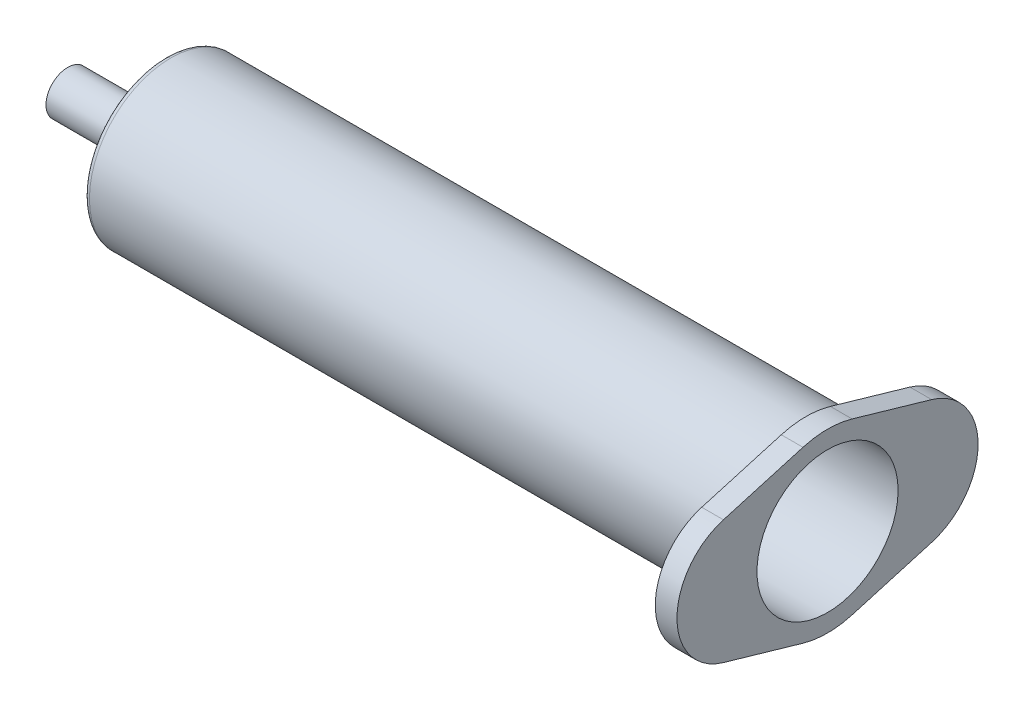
ISO-10303-21;
HEADER;
FILE_DESCRIPTION(('STEP AP214'),'2;1');
FILE_NAME('part.step','',(''),(''),'','','');
FILE_SCHEMA(('AUTOMOTIVE_DESIGN { 1 0 10303 214 1 1 1 1 }'));
ENDSEC;
DATA;
#1=APPLICATION_CONTEXT('core data for automotive mechanical design processes');
#2=APPLICATION_PROTOCOL_DEFINITION('international standard','automotive_design',2000,#1);
#3=PRODUCT_CONTEXT('',#1,'mechanical');
#4=PRODUCT('Part','Part','',(#3));
#5=PRODUCT_RELATED_PRODUCT_CATEGORY('part','',(#4));
#6=PRODUCT_DEFINITION_FORMATION('','',#4);
#7=PRODUCT_DEFINITION_CONTEXT('part definition',#1,'design');
#8=PRODUCT_DEFINITION('design','',#6,#7);
#9=PRODUCT_DEFINITION_SHAPE('','',#8);
#10=(LENGTH_UNIT() NAMED_UNIT(*) SI_UNIT(.MILLI.,.METRE.));
#11=(NAMED_UNIT(*) PLANE_ANGLE_UNIT() SI_UNIT($,.RADIAN.));
#12=(NAMED_UNIT(*) SI_UNIT($,.STERADIAN.) SOLID_ANGLE_UNIT());
#13=UNCERTAINTY_MEASURE_WITH_UNIT(LENGTH_MEASURE(1.E-05),#10,'distance_accuracy_value','');
#14=(GEOMETRIC_REPRESENTATION_CONTEXT(3) GLOBAL_UNCERTAINTY_ASSIGNED_CONTEXT((#13)) GLOBAL_UNIT_ASSIGNED_CONTEXT((#10,
#11,#12)) REPRESENTATION_CONTEXT('',''));
#15=CARTESIAN_POINT('',(0.,0.,0.));
#16=DIRECTION('',(0.,0.,1.));
#17=DIRECTION('',(1.,0.,0.));
#18=AXIS2_PLACEMENT_3D('',#15,#16,#17);
#19=CARTESIAN_POINT('',(59.,0.,0.));
#20=DIRECTION('',(1.,0.,0.));
#21=DIRECTION('',(0.,0.,-1.));
#22=AXIS2_PLACEMENT_3D('',#19,#20,#21);
#23=PLANE('',#22);
#24=CARTESIAN_POINT('',(59.,-3.,10.475));
#25=DIRECTION('',(-1.,0.,0.));
#26=DIRECTION('',(0.,0.,-1.));
#27=AXIS2_PLACEMENT_3D('',#24,#25,#26);
#28=CIRCLE('',#27,0.375);
#29=CARTESIAN_POINT('',(59.,-3.,10.1));
#30=VERTEX_POINT('',#29);
#31=CARTESIAN_POINT('',(59.,-3.,10.85));
#32=VERTEX_POINT('',#31);
#33=EDGE_CURVE('E327',#30,#32,#28,.T.);
#34=ORIENTED_EDGE('',*,*,#33,.F.);
#35=DIRECTION('',(0.,-1.,0.));
#36=VECTOR('',#35,1.);
#37=CARTESIAN_POINT('',(59.,-3.,10.1));
#38=LINE('',#37,#36);
#39=CARTESIAN_POINT('',(59.,3.,10.1));
#40=VERTEX_POINT('',#39);
#41=EDGE_CURVE('E312',#40,#30,#38,.T.);
#42=ORIENTED_EDGE('',*,*,#41,.F.);
#43=CARTESIAN_POINT('',(59.,3.,10.475));
#44=DIRECTION('',(-1.,0.,0.));
#45=DIRECTION('',(0.,0.,-1.));
#46=AXIS2_PLACEMENT_3D('',#43,#44,#45);
#47=CIRCLE('',#46,0.375);
#48=CARTESIAN_POINT('',(59.,3.,10.85));
#49=VERTEX_POINT('',#48);
#50=EDGE_CURVE('E317',#49,#40,#47,.T.);
#51=ORIENTED_EDGE('',*,*,#50,.F.);
#52=DIRECTION('',(0.,1.,0.));
#53=VECTOR('',#52,1.);
#54=CARTESIAN_POINT('',(59.,-3.,10.85));
#55=LINE('',#54,#53);
#56=EDGE_CURVE('E322',#32,#49,#55,.T.);
#57=ORIENTED_EDGE('',*,*,#56,.F.);
#58=EDGE_LOOP('',(#34,#42,#51,#57));
#59=FACE_BOUND('',#58,.T.);
#60=CARTESIAN_POINT('',(59.,-4.5,-8.725));
#61=DIRECTION('',(-1.,0.,0.));
#62=DIRECTION('',(0.,0.,1.));
#63=AXIS2_PLACEMENT_3D('',#60,#61,#62);
#64=CIRCLE('',#63,0.375);
#65=CARTESIAN_POINT('',(59.,-4.5,-9.1));
#66=VERTEX_POINT('',#65);
#67=CARTESIAN_POINT('',(59.,-4.5,-8.35));
#68=VERTEX_POINT('',#67);
#69=EDGE_CURVE('E406',#66,#68,#64,.T.);
#70=ORIENTED_EDGE('',*,*,#69,.F.);
#71=DIRECTION('',(0.,-1.,0.));
#72=VECTOR('',#71,1.);
#73=CARTESIAN_POINT('',(59.,-4.5,-9.1));
#74=LINE('',#73,#72);
#75=CARTESIAN_POINT('',(59.,4.5,-9.1));
#76=VERTEX_POINT('',#75);
#77=EDGE_CURVE('E391',#76,#66,#74,.T.);
#78=ORIENTED_EDGE('',*,*,#77,.F.);
#79=CARTESIAN_POINT('',(59.,4.5,-8.725));
#80=DIRECTION('',(-1.,0.,0.));
#81=DIRECTION('',(0.,0.,1.));
#82=AXIS2_PLACEMENT_3D('',#79,#80,#81);
#83=CIRCLE('',#82,0.375);
#84=CARTESIAN_POINT('',(59.,4.5,-8.35));
#85=VERTEX_POINT('',#84);
#86=EDGE_CURVE('E396',#85,#76,#83,.T.);
#87=ORIENTED_EDGE('',*,*,#86,.F.);
#88=DIRECTION('',(0.,1.,0.));
#89=VECTOR('',#88,1.);
#90=CARTESIAN_POINT('',(59.,-4.5,-8.35));
#91=LINE('',#90,#89);
#92=EDGE_CURVE('E401',#68,#85,#91,.T.);
#93=ORIENTED_EDGE('',*,*,#92,.F.);
#94=EDGE_LOOP('',(#70,#78,#87,#93));
#95=FACE_BOUND('',#94,.T.);
#96=CARTESIAN_POINT('',(59.,-1.5,-12.225));
#97=DIRECTION('',(-1.,0.,0.));
#98=DIRECTION('',(0.,0.,1.));
#99=AXIS2_PLACEMENT_3D('',#96,#97,#98);
#100=CIRCLE('',#99,0.375);
#101=CARTESIAN_POINT('',(59.,-1.5,-12.6));
#102=VERTEX_POINT('',#101);
#103=CARTESIAN_POINT('',(59.,-1.5,-11.85));
#104=VERTEX_POINT('',#103);
#105=EDGE_CURVE('E451',#102,#104,#100,.T.);
#106=ORIENTED_EDGE('',*,*,#105,.F.);
#107=DIRECTION('',(0.,-1.,0.));
#108=VECTOR('',#107,1.);
#109=CARTESIAN_POINT('',(59.,-1.5,-12.6));
#110=LINE('',#109,#108);
#111=CARTESIAN_POINT('',(59.,1.5,-12.6));
#112=VERTEX_POINT('',#111);
#113=EDGE_CURVE('E466',#112,#102,#110,.T.);
#114=ORIENTED_EDGE('',*,*,#113,.F.);
#115=CARTESIAN_POINT('',(59.,1.5,-12.225));
#116=DIRECTION('',(-1.,0.,0.));
#117=DIRECTION('',(0.,0.,1.));
#118=AXIS2_PLACEMENT_3D('',#115,#116,#117);
#119=CIRCLE('',#118,0.375);
#120=CARTESIAN_POINT('',(59.,1.5,-11.85));
#121=VERTEX_POINT('',#120);
#122=EDGE_CURVE('E461',#121,#112,#119,.T.);
#123=ORIENTED_EDGE('',*,*,#122,.F.);
#124=DIRECTION('',(0.,1.,0.));
#125=VECTOR('',#124,1.);
#126=CARTESIAN_POINT('',(59.,-1.5,-11.85));
#127=LINE('',#126,#125);
#128=EDGE_CURVE('E456',#104,#121,#127,.T.);
#129=ORIENTED_EDGE('',*,*,#128,.F.);
#130=EDGE_LOOP('',(#106,#114,#123,#129));
#131=FACE_BOUND('',#130,.T.);
#132=CARTESIAN_POINT('',(59.,0.,0.));
#133=DIRECTION('',(1.,0.,0.));
#134=DIRECTION('',(0.,0.,-1.));
#135=AXIS2_PLACEMENT_3D('',#132,#133,#134);
#136=CIRCLE('',#135,8.13743404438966);
#137=CARTESIAN_POINT('',(59.,7.81680288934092,-2.26173062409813));
#138=VERTEX_POINT('',#137);
#139=CARTESIAN_POINT('',(59.,7.81680288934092,2.26173062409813));
#140=VERTEX_POINT('',#139);
#141=EDGE_CURVE('E536',#138,#140,#136,.T.);
#142=ORIENTED_EDGE('',*,*,#141,.F.);
#143=DIRECTION('',(0.,0.277941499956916,0.960598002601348));
#144=VECTOR('',#143,1.);
#145=CARTESIAN_POINT('',(59.,7.81680288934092,-2.26173062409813));
#146=LINE('',#145,#144);
#147=CARTESIAN_POINT('',(59.,5.69644909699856,-9.58991881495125));
#148=VERTEX_POINT('',#147);
#149=EDGE_CURVE('E571',#148,#138,#146,.T.);
#150=ORIENTED_EDGE('',*,*,#149,.F.);
#151=CARTESIAN_POINT('',(59.,0.,-7.94169593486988));
#152=DIRECTION('',(1.,0.,0.));
#153=DIRECTION('',(0.,0.,1.));
#154=AXIS2_PLACEMENT_3D('',#151,#152,#153);
#155=CIRCLE('',#154,5.93010716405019);
#156=CARTESIAN_POINT('',(59.,-5.69644909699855,-9.58991881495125));
#157=VERTEX_POINT('',#156);
#158=EDGE_CURVE('E566',#157,#148,#155,.T.);
#159=ORIENTED_EDGE('',*,*,#158,.F.);
#160=DIRECTION('',(0.,0.277941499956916,-0.960598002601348));
#161=VECTOR('',#160,1.);
#162=CARTESIAN_POINT('',(59.,-7.81680288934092,-2.26173062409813));
#163=LINE('',#162,#161);
#164=CARTESIAN_POINT('',(59.,-7.81680288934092,-2.26173062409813));
#165=VERTEX_POINT('',#164);
#166=EDGE_CURVE('E561',#165,#157,#163,.T.);
#167=ORIENTED_EDGE('',*,*,#166,.F.);
#168=CARTESIAN_POINT('',(59.,0.,0.));
#169=DIRECTION('',(1.,0.,0.));
#170=DIRECTION('',(0.,0.,-1.));
#171=AXIS2_PLACEMENT_3D('',#168,#169,#170);
#172=CIRCLE('',#171,8.13743404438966);
#173=CARTESIAN_POINT('',(59.,-7.81680288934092,2.26173062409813));
#174=VERTEX_POINT('',#173);
#175=EDGE_CURVE('E556',#174,#165,#172,.T.);
#176=ORIENTED_EDGE('',*,*,#175,.F.);
#177=DIRECTION('',(0.,-0.277941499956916,-0.960598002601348));
#178=VECTOR('',#177,1.);
#179=CARTESIAN_POINT('',(59.,-7.81680288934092,2.26173062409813));
#180=LINE('',#179,#178);
#181=CARTESIAN_POINT('',(59.,-5.69644909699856,9.58991881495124));
#182=VERTEX_POINT('',#181);
#183=EDGE_CURVE('E551',#182,#174,#180,.T.);
#184=ORIENTED_EDGE('',*,*,#183,.F.);
#185=CARTESIAN_POINT('',(59.,0.,7.94169593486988));
#186=DIRECTION('',(1.,0.,0.));
#187=DIRECTION('',(0.,0.,-1.));
#188=AXIS2_PLACEMENT_3D('',#185,#186,#187);
#189=CIRCLE('',#188,5.93010716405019);
#190=CARTESIAN_POINT('',(59.,5.69644909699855,9.58991881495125));
#191=VERTEX_POINT('',#190);
#192=EDGE_CURVE('E546',#191,#182,#189,.T.);
#193=ORIENTED_EDGE('',*,*,#192,.F.);
#194=DIRECTION('',(0.,-0.277941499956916,0.960598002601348));
#195=VECTOR('',#194,1.);
#196=CARTESIAN_POINT('',(59.,7.81680288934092,2.26173062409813));
#197=LINE('',#196,#195);
#198=EDGE_CURVE('E541',#140,#191,#197,.T.);
#199=ORIENTED_EDGE('',*,*,#198,.F.);
#200=EDGE_LOOP('',(#142,#150,#159,#167,#176,#184,#193,#199));
#201=FACE_BOUND('',#200,.T.);
#202=CARTESIAN_POINT('',(59.,0.,0.));
#203=DIRECTION('',(1.,0.,0.));
#204=DIRECTION('',(0.,0.,-1.));
#205=AXIS2_PLACEMENT_3D('',#202,#203,#204);
#206=CIRCLE('',#205,7.5);
#207=CARTESIAN_POINT('',(59.,0.,7.5));
#208=VERTEX_POINT('',#207);
#209=EDGE_CURVE('E666',#208,#208,#206,.T.);
#210=ORIENTED_EDGE('',*,*,#209,.T.);
#211=EDGE_LOOP('',(#210));
#212=FACE_BOUND('',#211,.T.);
#213=CARTESIAN_POINT('',(59.,-3.,-10.475));
#214=DIRECTION('',(-1.,0.,0.));
#215=DIRECTION('',(0.,0.,1.));
#216=AXIS2_PLACEMENT_3D('',#213,#214,#215);
#217=CIRCLE('',#216,0.375);
#218=CARTESIAN_POINT('',(59.,-3.,-10.85));
#219=VERTEX_POINT('',#218);
#220=CARTESIAN_POINT('',(59.,-3.,-10.1));
#221=VERTEX_POINT('',#220);
#222=EDGE_CURVE('E446',#219,#221,#217,.T.);
#223=ORIENTED_EDGE('',*,*,#222,.F.);
#224=DIRECTION('',(0.,-1.,0.));
#225=VECTOR('',#224,1.);
#226=CARTESIAN_POINT('',(59.,-3.,-10.85));
#227=LINE('',#226,#225);
#228=CARTESIAN_POINT('',(59.,3.,-10.85));
#229=VERTEX_POINT('',#228);
#230=EDGE_CURVE('E431',#229,#219,#227,.T.);
#231=ORIENTED_EDGE('',*,*,#230,.F.);
#232=CARTESIAN_POINT('',(59.,3.,-10.475));
#233=DIRECTION('',(-1.,0.,0.));
#234=DIRECTION('',(0.,0.,1.));
#235=AXIS2_PLACEMENT_3D('',#232,#233,#234);
#236=CIRCLE('',#235,0.375);
#237=CARTESIAN_POINT('',(59.,3.,-10.1));
#238=VERTEX_POINT('',#237);
#239=EDGE_CURVE('E436',#238,#229,#236,.T.);
#240=ORIENTED_EDGE('',*,*,#239,.F.);
#241=DIRECTION('',(0.,1.,0.));
#242=VECTOR('',#241,1.);
#243=CARTESIAN_POINT('',(59.,-3.,-10.1));
#244=LINE('',#243,#242);
#245=EDGE_CURVE('E441',#221,#238,#244,.T.);
#246=ORIENTED_EDGE('',*,*,#245,.F.);
#247=EDGE_LOOP('',(#223,#231,#240,#246));
#248=FACE_BOUND('',#247,.T.);
#249=CARTESIAN_POINT('',(59.,-1.5,12.225));
#250=DIRECTION('',(-1.,0.,0.));
#251=DIRECTION('',(0.,0.,-1.));
#252=AXIS2_PLACEMENT_3D('',#249,#250,#251);
#253=CIRCLE('',#252,0.375);
#254=CARTESIAN_POINT('',(59.,-1.5,11.85));
#255=VERTEX_POINT('',#254);
#256=CARTESIAN_POINT('',(59.,-1.5,12.6));
#257=VERTEX_POINT('',#256);
#258=EDGE_CURVE('E367',#255,#257,#253,.T.);
#259=ORIENTED_EDGE('',*,*,#258,.F.);
#260=DIRECTION('',(0.,-1.,0.));
#261=VECTOR('',#260,1.);
#262=CARTESIAN_POINT('',(59.,-1.5,11.85));
#263=LINE('',#262,#261);
#264=CARTESIAN_POINT('',(59.,1.5,11.85));
#265=VERTEX_POINT('',#264);
#266=EDGE_CURVE('E352',#265,#255,#263,.T.);
#267=ORIENTED_EDGE('',*,*,#266,.F.);
#268=CARTESIAN_POINT('',(59.,1.5,12.225));
#269=DIRECTION('',(-1.,0.,0.));
#270=DIRECTION('',(0.,0.,-1.));
#271=AXIS2_PLACEMENT_3D('',#268,#269,#270);
#272=CIRCLE('',#271,0.375);
#273=CARTESIAN_POINT('',(59.,1.5,12.6));
#274=VERTEX_POINT('',#273);
#275=EDGE_CURVE('E357',#274,#265,#272,.T.);
#276=ORIENTED_EDGE('',*,*,#275,.F.);
#277=DIRECTION('',(0.,1.,0.));
#278=VECTOR('',#277,1.);
#279=CARTESIAN_POINT('',(59.,-1.5,12.6));
#280=LINE('',#279,#278);
#281=EDGE_CURVE('E362',#257,#274,#280,.T.);
#282=ORIENTED_EDGE('',*,*,#281,.F.);
#283=EDGE_LOOP('',(#259,#267,#276,#282));
#284=FACE_BOUND('',#283,.T.);
#285=CARTESIAN_POINT('',(59.,-4.5,8.725));
#286=DIRECTION('',(-1.,0.,0.));
#287=DIRECTION('',(0.,0.,-1.));
#288=AXIS2_PLACEMENT_3D('',#285,#286,#287);
#289=CIRCLE('',#288,0.375);
#290=CARTESIAN_POINT('',(59.,-4.5,8.35));
#291=VERTEX_POINT('',#290);
#292=CARTESIAN_POINT('',(59.,-4.5,9.1));
#293=VERTEX_POINT('',#292);
#294=EDGE_CURVE('E287',#291,#293,#289,.T.);
#295=ORIENTED_EDGE('',*,*,#294,.F.);
#296=DIRECTION('',(0.,-1.,0.));
#297=VECTOR('',#296,1.);
#298=CARTESIAN_POINT('',(59.,-4.5,8.35));
#299=LINE('',#298,#297);
#300=CARTESIAN_POINT('',(59.,4.5,8.35));
#301=VERTEX_POINT('',#300);
#302=EDGE_CURVE('E272',#301,#291,#299,.T.);
#303=ORIENTED_EDGE('',*,*,#302,.F.);
#304=CARTESIAN_POINT('',(59.,4.5,8.725));
#305=DIRECTION('',(-1.,0.,0.));
#306=DIRECTION('',(0.,0.,-1.));
#307=AXIS2_PLACEMENT_3D('',#304,#305,#306);
#308=CIRCLE('',#307,0.375);
#309=CARTESIAN_POINT('',(59.,4.5,9.1));
#310=VERTEX_POINT('',#309);
#311=EDGE_CURVE('E277',#310,#301,#308,.T.);
#312=ORIENTED_EDGE('',*,*,#311,.F.);
#313=DIRECTION('',(0.,1.,0.));
#314=VECTOR('',#313,1.);
#315=CARTESIAN_POINT('',(59.,-4.5,9.1));
#316=LINE('',#315,#314);
#317=EDGE_CURVE('E282',#293,#310,#316,.T.);
#318=ORIENTED_EDGE('',*,*,#317,.F.);
#319=EDGE_LOOP('',(#295,#303,#312,#318));
#320=FACE_BOUND('',#319,.T.);
#321=ADVANCED_FACE('F43',(#59,#95,#131,#201,#212,#248,#284,#320),#23,.F.);
#322=CARTESIAN_POINT('',(61.,0.,0.));
#323=DIRECTION('',(-1.,0.,0.));
#324=DIRECTION('',(0.,0.,1.));
#325=AXIS2_PLACEMENT_3D('',#322,#323,#324);
#326=CYLINDRICAL_SURFACE('',#325,7.5);
#327=CARTESIAN_POINT('',(0.5,0.,0.));
#328=DIRECTION('',(1.,0.,0.));
#329=DIRECTION('',(0.,0.,-1.));
#330=AXIS2_PLACEMENT_3D('',#327,#328,#329);
#331=CIRCLE('',#330,7.5);
#332=CARTESIAN_POINT('',(0.499999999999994,0.,7.5));
#333=VERTEX_POINT('',#332);
#334=EDGE_CURVE('E656',#333,#333,#331,.T.);
#335=CARTESIAN_POINT('',(0.499999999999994,0.,7.5));
#336=CARTESIAN_POINT('',(1.10937499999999,0.,7.5));
#337=CARTESIAN_POINT('',(1.71874999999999,0.,7.5));
#338=CARTESIAN_POINT('',(2.93749999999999,0.,7.5));
#339=CARTESIAN_POINT('',(3.54687499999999,0.,7.5));
#340=CARTESIAN_POINT('',(4.76562499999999,0.,7.5));
#341=CARTESIAN_POINT('',(5.37499999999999,0.,7.5));
#342=CARTESIAN_POINT('',(6.59374999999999,0.,7.5));
#343=CARTESIAN_POINT('',(7.20312499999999,0.,7.5));
#344=CARTESIAN_POINT('',(8.42187499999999,0.,7.5));
#345=CARTESIAN_POINT('',(9.03124999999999,0.,7.5));
#346=CARTESIAN_POINT('',(10.25,0.,7.5));
#347=CARTESIAN_POINT('',(10.859375,0.,7.5));
#348=CARTESIAN_POINT('',(12.078125,0.,7.5));
#349=CARTESIAN_POINT('',(12.6875,0.,7.5));
#350=CARTESIAN_POINT('',(13.90625,0.,7.5));
#351=CARTESIAN_POINT('',(14.515625,0.,7.5));
#352=CARTESIAN_POINT('',(15.734375,0.,7.5));
#353=CARTESIAN_POINT('',(16.34375,0.,7.5));
#354=CARTESIAN_POINT('',(17.5625,0.,7.5));
#355=CARTESIAN_POINT('',(18.171875,0.,7.5));
#356=CARTESIAN_POINT('',(19.390625,0.,7.5));
#357=CARTESIAN_POINT('',(20.,0.,7.5));
#358=CARTESIAN_POINT('',(21.21875,0.,7.5));
#359=CARTESIAN_POINT('',(21.828125,0.,7.5));
#360=CARTESIAN_POINT('',(23.046875,0.,7.5));
#361=CARTESIAN_POINT('',(23.65625,0.,7.5));
#362=CARTESIAN_POINT('',(24.875,0.,7.5));
#363=CARTESIAN_POINT('',(25.484375,0.,7.5));
#364=CARTESIAN_POINT('',(26.703125,0.,7.5));
#365=CARTESIAN_POINT('',(27.3125,0.,7.5));
#366=CARTESIAN_POINT('',(28.53125,0.,7.5));
#367=CARTESIAN_POINT('',(29.140625,0.,7.5));
#368=CARTESIAN_POINT('',(30.359375,0.,7.5));
#369=CARTESIAN_POINT('',(30.96875,0.,7.5));
#370=CARTESIAN_POINT('',(32.1875,0.,7.5));
#371=CARTESIAN_POINT('',(32.796875,0.,7.5));
#372=CARTESIAN_POINT('',(34.015625,0.,7.5));
#373=CARTESIAN_POINT('',(34.625,0.,7.5));
#374=CARTESIAN_POINT('',(35.84375,0.,7.5));
#375=CARTESIAN_POINT('',(36.453125,0.,7.5));
#376=CARTESIAN_POINT('',(37.671875,0.,7.5));
#377=CARTESIAN_POINT('',(38.28125,0.,7.5));
#378=CARTESIAN_POINT('',(39.5,0.,7.5));
#379=CARTESIAN_POINT('',(40.109375,0.,7.5));
#380=CARTESIAN_POINT('',(41.328125,0.,7.5));
#381=CARTESIAN_POINT('',(41.9375,0.,7.5));
#382=CARTESIAN_POINT('',(43.15625,0.,7.5));
#383=CARTESIAN_POINT('',(43.765625,0.,7.5));
#384=CARTESIAN_POINT('',(44.984375,0.,7.5));
#385=CARTESIAN_POINT('',(45.59375,0.,7.5));
#386=CARTESIAN_POINT('',(46.8125,0.,7.5));
#387=CARTESIAN_POINT('',(47.421875,0.,7.5));
#388=CARTESIAN_POINT('',(48.640625,0.,7.5));
#389=CARTESIAN_POINT('',(49.25,0.,7.5));
#390=CARTESIAN_POINT('',(50.46875,0.,7.5));
#391=CARTESIAN_POINT('',(51.078125,0.,7.5));
#392=CARTESIAN_POINT('',(52.296875,0.,7.5));
#393=CARTESIAN_POINT('',(52.90625,0.,7.5));
#394=CARTESIAN_POINT('',(54.125,0.,7.5));
#395=CARTESIAN_POINT('',(54.734375,0.,7.5));
#396=CARTESIAN_POINT('',(55.953125,0.,7.5));
#397=CARTESIAN_POINT('',(56.5625,0.,7.5));
#398=CARTESIAN_POINT('',(57.78125,0.,7.5));
#399=CARTESIAN_POINT('',(58.390625,0.,7.5));
#400=CARTESIAN_POINT('',(59.,0.,7.5));
#401=B_SPLINE_CURVE_WITH_KNOTS('',3,(#335,#336,#337,#338,#339,#340,#341,#342,#343,#344,#345,
#346,#347,#348,#349,#350,#351,#352,#353,#354,#355,#356,#357,#358,#359,#360,#361,#362,#363,#364,
#365,#366,#367,#368,#369,#370,#371,#372,#373,#374,#375,#376,#377,#378,#379,#380,#381,#382,#383,
#384,#385,#386,#387,#388,#389,#390,#391,#392,#393,#394,#395,#396,#397,#398,#399,#400),
.UNSPECIFIED.,.F.,.F.,(4,2,2,2,2,2,2,2,2,2,2,2,2,2,2,2,2,2,2,2,2,2,2,2,2,2,2,2,2,2,2,2,4),(0.,
1.828125,3.65625,5.484375,7.3125,9.140625,10.96875,12.796875,14.625,16.453125,18.28125,
20.109375,21.9375,23.765625,25.59375,27.421875,29.25,31.078125,32.90625,34.734375,36.5625,
38.390625,40.21875,42.046875,43.875,45.703125,47.53125,49.359375,51.1875,53.015625,54.84375,
56.671875,58.5),.UNSPECIFIED.);
#402=EDGE_CURVE('BSEAM819',#333,#208,#401,.T.);
#403=ORIENTED_EDGE('',*,*,#334,.T.);
#404=ORIENTED_EDGE('',*,*,#209,.F.);
#405=ORIENTED_EDGE('',*,*,#402,.T.);
#406=ORIENTED_EDGE('',*,*,#402,.F.);
#407=EDGE_LOOP('',(#403,#405,#404,#406));
#408=FACE_BOUND('',#407,.T.);
#409=ADVANCED_FACE('F819',(#408),#326,.T.);
#410=CARTESIAN_POINT('',(2.,0.,0.));
#411=DIRECTION('',(1.,0.,0.));
#412=DIRECTION('',(0.,0.,-1.));
#413=AXIS2_PLACEMENT_3D('',#410,#411,#412);
#414=CYLINDRICAL_SURFACE('',#413,6.5);
#415=CARTESIAN_POINT('',(2.,0.,0.));
#416=DIRECTION('',(1.,0.,0.));
#417=DIRECTION('',(0.,0.,-1.));
#418=AXIS2_PLACEMENT_3D('',#415,#416,#417);
#419=CIRCLE('',#418,6.5);
#420=CARTESIAN_POINT('',(2.,0.,-6.5));
#421=VERTEX_POINT('',#420);
#422=EDGE_CURVE('E626',#421,#421,#419,.T.);
#423=ORIENTED_EDGE('',*,*,#422,.F.);
#424=EDGE_LOOP('',(#423));
#425=FACE_BOUND('',#424,.T.);
#426=CARTESIAN_POINT('',(61.,0.,0.));
#427=DIRECTION('',(1.,0.,0.));
#428=DIRECTION('',(0.,0.,-1.));
#429=AXIS2_PLACEMENT_3D('',#426,#427,#428);
#430=CIRCLE('',#429,6.5);
#431=CARTESIAN_POINT('',(61.,0.,-6.5));
#432=VERTEX_POINT('',#431);
#433=EDGE_CURVE('E491',#432,#432,#430,.T.);
#434=ORIENTED_EDGE('',*,*,#433,.T.);
#435=EDGE_LOOP('',(#434));
#436=FACE_BOUND('',#435,.T.);
#437=ADVANCED_FACE('F827',(#425,#436),#414,.F.);
#438=CARTESIAN_POINT('',(0.,0.,0.));
#439=DIRECTION('',(1.,0.,0.));
#440=DIRECTION('',(0.,0.,-1.));
#441=AXIS2_PLACEMENT_3D('',#438,#439,#440);
#442=PLANE('',#441);
#443=CARTESIAN_POINT('',(0.,0.,0.));
#444=DIRECTION('',(1.,0.,0.));
#445=DIRECTION('',(0.,0.,-1.));
#446=AXIS2_PLACEMENT_3D('',#443,#444,#445);
#447=CIRCLE('',#446,7.);
#448=CARTESIAN_POINT('',(0.,0.,-7.));
#449=VERTEX_POINT('',#448);
#450=EDGE_CURVE('E661',#449,#449,#447,.F.);
#451=ORIENTED_EDGE('',*,*,#450,.T.);
#452=EDGE_LOOP('',(#451));
#453=FACE_BOUND('',#452,.T.);
#454=CARTESIAN_POINT('',(0.,0.,0.));
#455=DIRECTION('',(1.,0.,0.));
#456=DIRECTION('',(0.,0.,-1.));
#457=AXIS2_PLACEMENT_3D('',#454,#455,#456);
#458=CIRCLE('',#457,2.5);
#459=CARTESIAN_POINT('',(0.,0.,-2.5));
#460=VERTEX_POINT('',#459);
#461=EDGE_CURVE('E651',#460,#460,#458,.T.);
#462=ORIENTED_EDGE('',*,*,#461,.T.);
#463=EDGE_LOOP('',(#462));
#464=FACE_BOUND('',#463,.T.);
#465=ADVANCED_FACE('F885',(#453,#464),#442,.F.);
#466=CARTESIAN_POINT('',(2.,0.,0.));
#467=DIRECTION('',(1.,0.,0.));
#468=DIRECTION('',(0.,0.,-1.));
#469=AXIS2_PLACEMENT_3D('',#466,#467,#468);
#470=PLANE('',#469);
#471=CARTESIAN_POINT('',(2.,0.,0.));
#472=DIRECTION('',(1.,0.,0.));
#473=DIRECTION('',(0.,0.,-1.));
#474=AXIS2_PLACEMENT_3D('',#471,#472,#473);
#475=CIRCLE('',#474,3.97546517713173);
#476=CARTESIAN_POINT('',(2.,0.,-3.97546517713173));
#477=VERTEX_POINT('',#476);
#478=EDGE_CURVE('E636',#477,#477,#475,.F.);
#479=ORIENTED_EDGE('',*,*,#478,.T.);
#480=EDGE_LOOP('',(#479));
#481=FACE_BOUND('',#480,.T.);
#482=ORIENTED_EDGE('',*,*,#422,.T.);
#483=EDGE_LOOP('',(#482));
#484=FACE_BOUND('',#483,.T.);
#485=ADVANCED_FACE('F881',(#481,#484),#470,.T.);
#486=CARTESIAN_POINT('',(-9.,0.,0.));
#487=DIRECTION('',(1.,0.,0.));
#488=DIRECTION('',(0.,0.,-1.));
#489=AXIS2_PLACEMENT_3D('',#486,#487,#488);
#490=CYLINDRICAL_SURFACE('',#489,2.);
#491=CARTESIAN_POINT('',(-0.5,0.,0.));
#492=DIRECTION('',(1.,0.,0.));
#493=DIRECTION('',(0.,0.,-1.));
#494=AXIS2_PLACEMENT_3D('',#491,#492,#493);
#495=CIRCLE('',#494,2.);
#496=CARTESIAN_POINT('',(-0.5,0.,-2.));
#497=VERTEX_POINT('',#496);
#498=EDGE_CURVE('E646',#497,#497,#495,.F.);
#499=ORIENTED_EDGE('',*,*,#498,.T.);
#500=EDGE_LOOP('',(#499));
#501=FACE_BOUND('',#500,.T.);
#502=CARTESIAN_POINT('',(-9.,0.,0.));
#503=DIRECTION('',(-1.,0.,0.));
#504=DIRECTION('',(0.,0.,1.));
#505=AXIS2_PLACEMENT_3D('',#502,#503,#504);
#506=CIRCLE('',#505,2.);
#507=CARTESIAN_POINT('',(-9.,0.,2.));
#508=VERTEX_POINT('',#507);
#509=EDGE_CURVE('E621',#508,#508,#506,.T.);
#510=ORIENTED_EDGE('',*,*,#509,.F.);
#511=EDGE_LOOP('',(#510));
#512=FACE_BOUND('',#511,.T.);
#513=ADVANCED_FACE('F877',(#501,#512),#490,.T.);
#514=CARTESIAN_POINT('',(-9.,0.,0.));
#515=DIRECTION('',(-1.,0.,0.));
#516=DIRECTION('',(0.,0.,1.));
#517=AXIS2_PLACEMENT_3D('',#514,#515,#516);
#518=PLANE('',#517);
#519=CARTESIAN_POINT('',(-9.,0.,0.));
#520=DIRECTION('',(-1.,0.,0.));
#521=DIRECTION('',(0.,0.,1.));
#522=AXIS2_PLACEMENT_3D('',#519,#520,#521);
#523=CIRCLE('',#522,1.5);
#524=CARTESIAN_POINT('',(-9.,0.,1.5));
#525=VERTEX_POINT('',#524);
#526=EDGE_CURVE('E616',#525,#525,#523,.T.);
#527=ORIENTED_EDGE('',*,*,#526,.F.);
#528=EDGE_LOOP('',(#527));
#529=FACE_BOUND('',#528,.T.);
#530=ORIENTED_EDGE('',*,*,#509,.T.);
#531=EDGE_LOOP('',(#530));
#532=FACE_BOUND('',#531,.T.);
#533=ADVANCED_FACE('F873',(#529,#532),#518,.T.);
#534=CARTESIAN_POINT('',(61.,0.,0.));
#535=DIRECTION('',(-1.,0.,0.));
#536=DIRECTION('',(0.,0.,1.));
#537=AXIS2_PLACEMENT_3D('',#534,#535,#536);
#538=CYLINDRICAL_SURFACE('',#537,1.5);
#539=CARTESIAN_POINT('',(0.0800875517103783,0.,0.));
#540=DIRECTION('',(1.,0.,0.));
#541=DIRECTION('',(0.,0.,-1.));
#542=AXIS2_PLACEMENT_3D('',#539,#540,#541);
#543=CIRCLE('',#542,1.5);
#544=CARTESIAN_POINT('',(0.0800875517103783,0.,-1.5));
#545=VERTEX_POINT('',#544);
#546=EDGE_CURVE('E631',#545,#545,#543,.T.);
#547=ORIENTED_EDGE('',*,*,#546,.T.);
#548=EDGE_LOOP('',(#547));
#549=FACE_BOUND('',#548,.T.);
#550=ORIENTED_EDGE('',*,*,#526,.T.);
#551=EDGE_LOOP('',(#550));
#552=FACE_BOUND('',#551,.T.);
#553=ADVANCED_FACE('F869',(#549,#552),#538,.F.);
#554=CARTESIAN_POINT('',(0.0800875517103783,0.,0.));
#555=DIRECTION('',(1.,0.,0.));
#556=DIRECTION('',(0.,0.,-1.));
#557=AXIS2_PLACEMENT_3D('',#554,#555,#556);
#558=CONICAL_SURFACE('',#557,1.5,0.663225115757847);
#559=CARTESIAN_POINT('',(1.23132295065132,0.,0.));
#560=DIRECTION('',(-1.,0.,0.));
#561=DIRECTION('',(0.,0.,1.));
#562=AXIS2_PLACEMENT_3D('',#559,#560,#561);
#563=CIRCLE('',#562,2.39944366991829);
#564=CARTESIAN_POINT('',(1.23132295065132,0.,2.39944366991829));
#565=VERTEX_POINT('',#564);
#566=EDGE_CURVE('E641',#565,#565,#563,.F.);
#567=ORIENTED_EDGE('',*,*,#566,.T.);
#568=EDGE_LOOP('',(#567));
#569=FACE_BOUND('',#568,.T.);
#570=ORIENTED_EDGE('',*,*,#546,.F.);
#571=EDGE_LOOP('',(#570));
#572=FACE_BOUND('',#571,.T.);
#573=ADVANCED_FACE('F872',(#569,#572),#558,.F.);
#574=CARTESIAN_POINT('',(0.,0.,0.));
#575=DIRECTION('',(1.,0.,0.));
#576=DIRECTION('',(0.,0.,-1.));
#577=AXIS2_PLACEMENT_3D('',#574,#575,#576);
#578=TOROIDAL_SURFACE('',#577,3.97546517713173,2.);
#579=ORIENTED_EDGE('',*,*,#566,.F.);
#580=EDGE_LOOP('',(#579));
#581=FACE_BOUND('',#580,.T.);
#582=ORIENTED_EDGE('',*,*,#478,.F.);
#583=EDGE_LOOP('',(#582));
#584=FACE_BOUND('',#583,.T.);
#585=ADVANCED_FACE('F900',(#581,#584),#578,.T.);
#586=CARTESIAN_POINT('',(-0.5,0.,0.));
#587=DIRECTION('',(1.,0.,0.));
#588=DIRECTION('',(0.,0.,-1.));
#589=AXIS2_PLACEMENT_3D('',#586,#587,#588);
#590=TOROIDAL_SURFACE('',#589,2.5,0.5);
#591=ORIENTED_EDGE('',*,*,#461,.F.);
#592=EDGE_LOOP('',(#591));
#593=FACE_BOUND('',#592,.T.);
#594=ORIENTED_EDGE('',*,*,#498,.F.);
#595=EDGE_LOOP('',(#594));
#596=FACE_BOUND('',#595,.T.);
#597=ADVANCED_FACE('F904',(#593,#596),#590,.F.);
#598=CARTESIAN_POINT('',(0.5,0.,0.));
#599=DIRECTION('',(1.,0.,0.));
#600=DIRECTION('',(0.,0.,-1.));
#601=AXIS2_PLACEMENT_3D('',#598,#599,#600);
#602=TOROIDAL_SURFACE('',#601,7.,0.5);
#603=ORIENTED_EDGE('',*,*,#450,.F.);
#604=EDGE_LOOP('',(#603));
#605=FACE_BOUND('',#604,.T.);
#606=ORIENTED_EDGE('',*,*,#334,.F.);
#607=EDGE_LOOP('',(#606));
#608=FACE_BOUND('',#607,.T.);
#609=ADVANCED_FACE('F867',(#605,#608),#602,.T.);
#610=CARTESIAN_POINT('',(59.,0.,0.));
#611=DIRECTION('',(1.,0.,0.));
#612=DIRECTION('',(0.,0.,-1.));
#613=AXIS2_PLACEMENT_3D('',#610,#611,#612);
#614=CYLINDRICAL_SURFACE('',#613,8.13743404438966);
#615=CARTESIAN_POINT('',(61.,0.,0.));
#616=DIRECTION('',(1.,0.,0.));
#617=DIRECTION('',(0.,0.,-1.));
#618=AXIS2_PLACEMENT_3D('',#615,#616,#617);
#619=CIRCLE('',#618,8.13743404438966);
#620=CARTESIAN_POINT('',(61.,7.81680288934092,-2.26173062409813));
#621=VERTEX_POINT('',#620);
#622=CARTESIAN_POINT('',(61.,7.81680288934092,2.26173062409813));
#623=VERTEX_POINT('',#622);
#624=EDGE_CURVE('E496',#621,#623,#619,.T.);
#625=ORIENTED_EDGE('',*,*,#624,.F.);
#626=DIRECTION('',(1.,0.,0.));
#627=VECTOR('',#626,1.);
#628=CARTESIAN_POINT('',(59.,7.81680288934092,-2.26173062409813));
#629=LINE('',#628,#627);
#630=EDGE_CURVE('E611',#138,#621,#629,.T.);
#631=ORIENTED_EDGE('',*,*,#630,.F.);
#632=ORIENTED_EDGE('',*,*,#141,.T.);
#633=DIRECTION('',(1.,0.,0.));
#634=VECTOR('',#633,1.);
#635=CARTESIAN_POINT('',(59.,7.81680288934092,2.26173062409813));
#636=LINE('',#635,#634);
#637=EDGE_CURVE('E576',#140,#623,#636,.T.);
#638=ORIENTED_EDGE('',*,*,#637,.T.);
#639=EDGE_LOOP('',(#625,#631,#632,#638));
#640=FACE_BOUND('',#639,.T.);
#641=ADVANCED_FACE('F839',(#640),#614,.T.);
#642=CARTESIAN_POINT('',(59.,7.81680288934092,-2.26173062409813));
#643=DIRECTION('',(0.,0.960598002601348,-0.277941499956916));
#644=DIRECTION('',(0.,0.277941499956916,0.960598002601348));
#645=AXIS2_PLACEMENT_3D('',#642,#643,#644);
#646=PLANE('',#645);
#647=DIRECTION('',(0.,0.277941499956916,0.960598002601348));
#648=VECTOR('',#647,1.);
#649=CARTESIAN_POINT('',(61.,7.81680288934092,-2.26173062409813));
#650=LINE('',#649,#648);
#651=CARTESIAN_POINT('',(61.,5.69644909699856,-9.58991881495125));
#652=VERTEX_POINT('',#651);
#653=EDGE_CURVE('E531',#652,#621,#650,.T.);
#654=ORIENTED_EDGE('',*,*,#653,.F.);
#655=DIRECTION('',(1.,0.,0.));
#656=VECTOR('',#655,1.);
#657=CARTESIAN_POINT('',(59.,5.69644909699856,-9.58991881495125));
#658=LINE('',#657,#656);
#659=EDGE_CURVE('E606',#148,#652,#658,.T.);
#660=ORIENTED_EDGE('',*,*,#659,.F.);
#661=ORIENTED_EDGE('',*,*,#149,.T.);
#662=ORIENTED_EDGE('',*,*,#630,.T.);
#663=EDGE_LOOP('',(#654,#660,#661,#662));
#664=FACE_BOUND('',#663,.T.);
#665=ADVANCED_FACE('F835',(#664),#646,.T.);
#666=CARTESIAN_POINT('',(59.,0.,-7.94169593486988));
#667=DIRECTION('',(1.,0.,0.));
#668=DIRECTION('',(0.,0.,-1.));
#669=AXIS2_PLACEMENT_3D('',#666,#667,#668);
#670=CYLINDRICAL_SURFACE('',#669,5.93010716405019);
#671=CARTESIAN_POINT('',(61.,0.,-7.94169593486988));
#672=DIRECTION('',(1.,0.,0.));
#673=DIRECTION('',(0.,0.,1.));
#674=AXIS2_PLACEMENT_3D('',#671,#672,#673);
#675=CIRCLE('',#674,5.93010716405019);
#676=CARTESIAN_POINT('',(61.,-5.69644909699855,-9.58991881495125));
#677=VERTEX_POINT('',#676);
#678=EDGE_CURVE('E526',#677,#652,#675,.T.);
#679=ORIENTED_EDGE('',*,*,#678,.F.);
#680=DIRECTION('',(1.,0.,0.));
#681=VECTOR('',#680,1.);
#682=CARTESIAN_POINT('',(59.,-5.69644909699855,-9.58991881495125));
#683=LINE('',#682,#681);
#684=EDGE_CURVE('E601',#157,#677,#683,.T.);
#685=ORIENTED_EDGE('',*,*,#684,.F.);
#686=ORIENTED_EDGE('',*,*,#158,.T.);
#687=ORIENTED_EDGE('',*,*,#659,.T.);
#688=EDGE_LOOP('',(#679,#685,#686,#687));
#689=FACE_BOUND('',#688,.T.);
#690=ADVANCED_FACE('F838',(#689),#670,.T.);
#691=CARTESIAN_POINT('',(59.,-7.81680288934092,-2.26173062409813));
#692=DIRECTION('',(0.,-0.960598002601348,-0.277941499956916));
#693=DIRECTION('',(0.,0.277941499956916,-0.960598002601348));
#694=AXIS2_PLACEMENT_3D('',#691,#692,#693);
#695=PLANE('',#694);
#696=DIRECTION('',(0.,0.277941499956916,-0.960598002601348));
#697=VECTOR('',#696,1.);
#698=CARTESIAN_POINT('',(61.,-7.81680288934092,-2.26173062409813));
#699=LINE('',#698,#697);
#700=CARTESIAN_POINT('',(61.,-7.81680288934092,-2.26173062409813));
#701=VERTEX_POINT('',#700);
#702=EDGE_CURVE('E521',#701,#677,#699,.T.);
#703=ORIENTED_EDGE('',*,*,#702,.F.);
#704=DIRECTION('',(1.,0.,0.));
#705=VECTOR('',#704,1.);
#706=CARTESIAN_POINT('',(59.,-7.81680288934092,-2.26173062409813));
#707=LINE('',#706,#705);
#708=EDGE_CURVE('E596',#165,#701,#707,.T.);
#709=ORIENTED_EDGE('',*,*,#708,.F.);
#710=ORIENTED_EDGE('',*,*,#166,.T.);
#711=ORIENTED_EDGE('',*,*,#684,.T.);
#712=EDGE_LOOP('',(#703,#709,#710,#711));
#713=FACE_BOUND('',#712,.T.);
#714=ADVANCED_FACE('F843',(#713),#695,.T.);
#715=CARTESIAN_POINT('',(59.,0.,0.));
#716=DIRECTION('',(1.,0.,0.));
#717=DIRECTION('',(0.,0.,-1.));
#718=AXIS2_PLACEMENT_3D('',#715,#716,#717);
#719=CYLINDRICAL_SURFACE('',#718,8.13743404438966);
#720=CARTESIAN_POINT('',(61.,0.,0.));
#721=DIRECTION('',(1.,0.,0.));
#722=DIRECTION('',(0.,0.,-1.));
#723=AXIS2_PLACEMENT_3D('',#720,#721,#722);
#724=CIRCLE('',#723,8.13743404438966);
#725=CARTESIAN_POINT('',(61.,-7.81680288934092,2.26173062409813));
#726=VERTEX_POINT('',#725);
#727=EDGE_CURVE('E516',#726,#701,#724,.T.);
#728=ORIENTED_EDGE('',*,*,#727,.F.);
#729=DIRECTION('',(1.,0.,0.));
#730=VECTOR('',#729,1.);
#731=CARTESIAN_POINT('',(59.,-7.81680288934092,2.26173062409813));
#732=LINE('',#731,#730);
#733=EDGE_CURVE('E591',#174,#726,#732,.T.);
#734=ORIENTED_EDGE('',*,*,#733,.F.);
#735=ORIENTED_EDGE('',*,*,#175,.T.);
#736=ORIENTED_EDGE('',*,*,#708,.T.);
#737=EDGE_LOOP('',(#728,#734,#735,#736));
#738=FACE_BOUND('',#737,.T.);
#739=ADVANCED_FACE('F847',(#738),#719,.T.);
#740=CARTESIAN_POINT('',(59.,-7.81680288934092,2.26173062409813));
#741=DIRECTION('',(0.,-0.960598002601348,0.277941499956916));
#742=DIRECTION('',(0.,-0.277941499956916,-0.960598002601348));
#743=AXIS2_PLACEMENT_3D('',#740,#741,#742);
#744=PLANE('',#743);
#745=DIRECTION('',(0.,-0.277941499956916,-0.960598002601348));
#746=VECTOR('',#745,1.);
#747=CARTESIAN_POINT('',(61.,-7.81680288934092,2.26173062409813));
#748=LINE('',#747,#746);
#749=CARTESIAN_POINT('',(61.,-5.69644909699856,9.58991881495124));
#750=VERTEX_POINT('',#749);
#751=EDGE_CURVE('E511',#750,#726,#748,.T.);
#752=ORIENTED_EDGE('',*,*,#751,.F.);
#753=DIRECTION('',(1.,0.,0.));
#754=VECTOR('',#753,1.);
#755=CARTESIAN_POINT('',(59.,-5.69644909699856,9.58991881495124));
#756=LINE('',#755,#754);
#757=EDGE_CURVE('E586',#182,#750,#756,.T.);
#758=ORIENTED_EDGE('',*,*,#757,.F.);
#759=ORIENTED_EDGE('',*,*,#183,.T.);
#760=ORIENTED_EDGE('',*,*,#733,.T.);
#761=EDGE_LOOP('',(#752,#758,#759,#760));
#762=FACE_BOUND('',#761,.T.);
#763=ADVANCED_FACE('F851',(#762),#744,.T.);
#764=CARTESIAN_POINT('',(59.,0.,7.94169593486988));
#765=DIRECTION('',(1.,0.,0.));
#766=DIRECTION('',(0.,0.,-1.));
#767=AXIS2_PLACEMENT_3D('',#764,#765,#766);
#768=CYLINDRICAL_SURFACE('',#767,5.93010716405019);
#769=CARTESIAN_POINT('',(61.,0.,7.94169593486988));
#770=DIRECTION('',(1.,0.,0.));
#771=DIRECTION('',(0.,0.,-1.));
#772=AXIS2_PLACEMENT_3D('',#769,#770,#771);
#773=CIRCLE('',#772,5.93010716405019);
#774=CARTESIAN_POINT('',(61.,5.69644909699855,9.58991881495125));
#775=VERTEX_POINT('',#774);
#776=EDGE_CURVE('E506',#775,#750,#773,.T.);
#777=ORIENTED_EDGE('',*,*,#776,.F.);
#778=DIRECTION('',(1.,0.,0.));
#779=VECTOR('',#778,1.);
#780=CARTESIAN_POINT('',(59.,5.69644909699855,9.58991881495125));
#781=LINE('',#780,#779);
#782=EDGE_CURVE('E581',#191,#775,#781,.T.);
#783=ORIENTED_EDGE('',*,*,#782,.F.);
#784=ORIENTED_EDGE('',*,*,#192,.T.);
#785=ORIENTED_EDGE('',*,*,#757,.T.);
#786=EDGE_LOOP('',(#777,#783,#784,#785));
#787=FACE_BOUND('',#786,.T.);
#788=ADVANCED_FACE('F855',(#787),#768,.T.);
#789=CARTESIAN_POINT('',(59.,7.81680288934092,2.26173062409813));
#790=DIRECTION('',(0.,0.960598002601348,0.277941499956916));
#791=DIRECTION('',(0.,-0.277941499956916,0.960598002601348));
#792=AXIS2_PLACEMENT_3D('',#789,#790,#791);
#793=PLANE('',#792);
#794=DIRECTION('',(0.,-0.277941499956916,0.960598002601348));
#795=VECTOR('',#794,1.);
#796=CARTESIAN_POINT('',(61.,7.81680288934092,2.26173062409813));
#797=LINE('',#796,#795);
#798=EDGE_CURVE('E501',#623,#775,#797,.T.);
#799=ORIENTED_EDGE('',*,*,#798,.F.);
#800=ORIENTED_EDGE('',*,*,#637,.F.);
#801=ORIENTED_EDGE('',*,*,#198,.T.);
#802=ORIENTED_EDGE('',*,*,#782,.T.);
#803=EDGE_LOOP('',(#799,#800,#801,#802));
#804=FACE_BOUND('',#803,.T.);
#805=ADVANCED_FACE('F859',(#804),#793,.T.);
#806=CARTESIAN_POINT('',(61.,0.,0.));
#807=DIRECTION('',(1.,0.,0.));
#808=DIRECTION('',(0.,0.,-1.));
#809=AXIS2_PLACEMENT_3D('',#806,#807,#808);
#810=PLANE('',#809);
#811=ORIENTED_EDGE('',*,*,#433,.F.);
#812=EDGE_LOOP('',(#811));
#813=FACE_BOUND('',#812,.T.);
#814=ORIENTED_EDGE('',*,*,#624,.T.);
#815=ORIENTED_EDGE('',*,*,#798,.T.);
#816=ORIENTED_EDGE('',*,*,#776,.T.);
#817=ORIENTED_EDGE('',*,*,#751,.T.);
#818=ORIENTED_EDGE('',*,*,#727,.T.);
#819=ORIENTED_EDGE('',*,*,#702,.T.);
#820=ORIENTED_EDGE('',*,*,#678,.T.);
#821=ORIENTED_EDGE('',*,*,#653,.T.);
#822=EDGE_LOOP('',(#814,#815,#816,#817,#818,#819,#820,#821));
#823=FACE_BOUND('',#822,.T.);
#824=ADVANCED_FACE('F863',(#813,#823),#810,.T.);
#825=CARTESIAN_POINT('',(58.5,-1.5,-12.225));
#826=DIRECTION('',(1.,0.,0.));
#827=DIRECTION('',(0.,0.,-1.));
#828=AXIS2_PLACEMENT_3D('',#825,#826,#827);
#829=CYLINDRICAL_SURFACE('',#828,0.375);
#830=DIRECTION('',(1.,0.,0.));
#831=VECTOR('',#830,1.);
#832=CARTESIAN_POINT('',(58.5,-1.5,-11.85));
#833=LINE('',#832,#831);
#834=CARTESIAN_POINT('',(58.875,-1.5,-11.85));
#835=VERTEX_POINT('',#834);
#836=EDGE_CURVE('E486',#835,#104,#833,.T.);
#837=ORIENTED_EDGE('',*,*,#836,.F.);
#838=CARTESIAN_POINT('',(58.875,-1.5,-12.225));
#839=DIRECTION('',(1.,0.,0.));
#840=DIRECTION('',(0.,0.,-1.));
#841=AXIS2_PLACEMENT_3D('',#838,#839,#840);
#842=CIRCLE('',#841,0.375);
#843=CARTESIAN_POINT('',(58.875,-1.5,-12.6));
#844=VERTEX_POINT('',#843);
#845=EDGE_CURVE('E746',#835,#844,#842,.T.);
#846=ORIENTED_EDGE('',*,*,#845,.T.);
#847=DIRECTION('',(1.,0.,0.));
#848=VECTOR('',#847,1.);
#849=CARTESIAN_POINT('',(58.5,-1.5,-12.6));
#850=LINE('',#849,#848);
#851=EDGE_CURVE('E471',#844,#102,#850,.T.);
#852=ORIENTED_EDGE('',*,*,#851,.T.);
#853=ORIENTED_EDGE('',*,*,#105,.T.);
#854=EDGE_LOOP('',(#837,#846,#852,#853));
#855=FACE_BOUND('',#854,.T.);
#856=ADVANCED_FACE('F833',(#855),#829,.T.);
#857=CARTESIAN_POINT('',(58.5,-1.5,-11.85));
#858=DIRECTION('',(0.,0.,-1.));
#859=DIRECTION('',(-1.,0.,0.));
#860=AXIS2_PLACEMENT_3D('',#857,#858,#859);
#861=PLANE('',#860);
#862=DIRECTION('',(1.,0.,0.));
#863=VECTOR('',#862,1.);
#864=CARTESIAN_POINT('',(58.5,1.5,-11.85));
#865=LINE('',#864,#863);
#866=CARTESIAN_POINT('',(58.875,1.5,-11.85));
#867=VERTEX_POINT('',#866);
#868=EDGE_CURVE('E481',#867,#121,#865,.T.);
#869=ORIENTED_EDGE('',*,*,#868,.F.);
#870=DIRECTION('',(0.,1.,0.));
#871=VECTOR('',#870,1.);
#872=CARTESIAN_POINT('',(58.875,-1.5,-11.85));
#873=LINE('',#872,#871);
#874=EDGE_CURVE('E741',#867,#835,#873,.F.);
#875=ORIENTED_EDGE('',*,*,#874,.T.);
#876=ORIENTED_EDGE('',*,*,#836,.T.);
#877=ORIENTED_EDGE('',*,*,#128,.T.);
#878=EDGE_LOOP('',(#869,#875,#876,#877));
#879=FACE_BOUND('',#878,.T.);
#880=ADVANCED_FACE('F1226',(#879),#861,.F.);
#881=CARTESIAN_POINT('',(58.5,1.5,-12.225));
#882=DIRECTION('',(1.,0.,0.));
#883=DIRECTION('',(0.,0.,-1.));
#884=AXIS2_PLACEMENT_3D('',#881,#882,#883);
#885=CYLINDRICAL_SURFACE('',#884,0.375);
#886=DIRECTION('',(1.,0.,0.));
#887=VECTOR('',#886,1.);
#888=CARTESIAN_POINT('',(58.5,1.5,-12.6));
#889=LINE('',#888,#887);
#890=CARTESIAN_POINT('',(58.875,1.5,-12.6));
#891=VERTEX_POINT('',#890);
#892=EDGE_CURVE('E476',#891,#112,#889,.T.);
#893=ORIENTED_EDGE('',*,*,#892,.F.);
#894=CARTESIAN_POINT('',(58.875,1.5,-12.225));
#895=DIRECTION('',(1.,0.,0.));
#896=DIRECTION('',(0.,0.,-1.));
#897=AXIS2_PLACEMENT_3D('',#894,#895,#896);
#898=CIRCLE('',#897,0.375);
#899=EDGE_CURVE('E736',#891,#867,#898,.T.);
#900=ORIENTED_EDGE('',*,*,#899,.T.);
#901=ORIENTED_EDGE('',*,*,#868,.T.);
#902=ORIENTED_EDGE('',*,*,#122,.T.);
#903=EDGE_LOOP('',(#893,#900,#901,#902));
#904=FACE_BOUND('',#903,.T.);
#905=ADVANCED_FACE('F1223',(#904),#885,.T.);
#906=CARTESIAN_POINT('',(58.5,-1.5,-12.6));
#907=DIRECTION('',(0.,0.,1.));
#908=DIRECTION('',(1.,0.,0.));
#909=AXIS2_PLACEMENT_3D('',#906,#907,#908);
#910=PLANE('',#909);
#911=ORIENTED_EDGE('',*,*,#851,.F.);
#912=DIRECTION('',(0.,-1.,0.));
#913=VECTOR('',#912,1.);
#914=CARTESIAN_POINT('',(58.875,1.5,-12.6));
#915=LINE('',#914,#913);
#916=EDGE_CURVE('E731',#844,#891,#915,.F.);
#917=ORIENTED_EDGE('',*,*,#916,.T.);
#918=ORIENTED_EDGE('',*,*,#892,.T.);
#919=ORIENTED_EDGE('',*,*,#113,.T.);
#920=EDGE_LOOP('',(#911,#917,#918,#919));
#921=FACE_BOUND('',#920,.T.);
#922=ADVANCED_FACE('F1214',(#921),#910,.F.);
#923=CARTESIAN_POINT('',(58.5,-3.,-10.475));
#924=DIRECTION('',(1.,0.,0.));
#925=DIRECTION('',(0.,0.,-1.));
#926=AXIS2_PLACEMENT_3D('',#923,#924,#925);
#927=CYLINDRICAL_SURFACE('',#926,0.375);
#928=DIRECTION('',(1.,0.,0.));
#929=VECTOR('',#928,1.);
#930=CARTESIAN_POINT('',(58.5,-3.,-10.1));
#931=LINE('',#930,#929);
#932=CARTESIAN_POINT('',(58.875,-3.,-10.1));
#933=VERTEX_POINT('',#932);
#934=EDGE_CURVE('E411',#933,#221,#931,.T.);
#935=ORIENTED_EDGE('',*,*,#934,.F.);
#936=CARTESIAN_POINT('',(58.875,-3.,-10.475));
#937=DIRECTION('',(1.,0.,0.));
#938=DIRECTION('',(0.,0.,-1.));
#939=AXIS2_PLACEMENT_3D('',#936,#937,#938);
#940=CIRCLE('',#939,0.375);
#941=CARTESIAN_POINT('',(58.875,-3.,-10.85));
#942=VERTEX_POINT('',#941);
#943=EDGE_CURVE('E766',#933,#942,#940,.T.);
#944=ORIENTED_EDGE('',*,*,#943,.T.);
#945=DIRECTION('',(1.,0.,0.));
#946=VECTOR('',#945,1.);
#947=CARTESIAN_POINT('',(58.5,-3.,-10.85));
#948=LINE('',#947,#946);
#949=EDGE_CURVE('E426',#942,#219,#948,.T.);
#950=ORIENTED_EDGE('',*,*,#949,.T.);
#951=ORIENTED_EDGE('',*,*,#222,.T.);
#952=EDGE_LOOP('',(#935,#944,#950,#951));
#953=FACE_BOUND('',#952,.T.);
#954=ADVANCED_FACE('F1012',(#953),#927,.T.);
#955=CARTESIAN_POINT('',(58.5,-3.,-10.1));
#956=DIRECTION('',(0.,0.,-1.));
#957=DIRECTION('',(-1.,0.,0.));
#958=AXIS2_PLACEMENT_3D('',#955,#956,#957);
#959=PLANE('',#958);
#960=DIRECTION('',(1.,0.,0.));
#961=VECTOR('',#960,1.);
#962=CARTESIAN_POINT('',(58.5,3.,-10.1));
#963=LINE('',#962,#961);
#964=CARTESIAN_POINT('',(58.875,3.,-10.1));
#965=VERTEX_POINT('',#964);
#966=EDGE_CURVE('E416',#965,#238,#963,.T.);
#967=ORIENTED_EDGE('',*,*,#966,.F.);
#968=DIRECTION('',(0.,1.,0.));
#969=VECTOR('',#968,1.);
#970=CARTESIAN_POINT('',(58.875,-3.,-10.1));
#971=LINE('',#970,#969);
#972=EDGE_CURVE('E761',#965,#933,#971,.F.);
#973=ORIENTED_EDGE('',*,*,#972,.T.);
#974=ORIENTED_EDGE('',*,*,#934,.T.);
#975=ORIENTED_EDGE('',*,*,#245,.T.);
#976=EDGE_LOOP('',(#967,#973,#974,#975));
#977=FACE_BOUND('',#976,.T.);
#978=ADVANCED_FACE('F1007',(#977),#959,.F.);
#979=CARTESIAN_POINT('',(58.5,3.,-10.475));
#980=DIRECTION('',(1.,0.,0.));
#981=DIRECTION('',(0.,0.,-1.));
#982=AXIS2_PLACEMENT_3D('',#979,#980,#981);
#983=CYLINDRICAL_SURFACE('',#982,0.375);
#984=DIRECTION('',(1.,0.,0.));
#985=VECTOR('',#984,1.);
#986=CARTESIAN_POINT('',(58.5,3.,-10.85));
#987=LINE('',#986,#985);
#988=CARTESIAN_POINT('',(58.875,3.,-10.85));
#989=VERTEX_POINT('',#988);
#990=EDGE_CURVE('E421',#989,#229,#987,.T.);
#991=ORIENTED_EDGE('',*,*,#990,.F.);
#992=CARTESIAN_POINT('',(58.875,3.,-10.475));
#993=DIRECTION('',(1.,0.,0.));
#994=DIRECTION('',(0.,0.,-1.));
#995=AXIS2_PLACEMENT_3D('',#992,#993,#994);
#996=CIRCLE('',#995,0.375);
#997=EDGE_CURVE('E756',#989,#965,#996,.T.);
#998=ORIENTED_EDGE('',*,*,#997,.T.);
#999=ORIENTED_EDGE('',*,*,#966,.T.);
#1000=ORIENTED_EDGE('',*,*,#239,.T.);
#1001=EDGE_LOOP('',(#991,#998,#999,#1000));
#1002=FACE_BOUND('',#1001,.T.);
#1003=ADVANCED_FACE('F1032',(#1002),#983,.T.);
#1004=CARTESIAN_POINT('',(58.5,-3.,-10.85));
#1005=DIRECTION('',(0.,0.,1.));
#1006=DIRECTION('',(1.,0.,0.));
#1007=AXIS2_PLACEMENT_3D('',#1004,#1005,#1006);
#1008=PLANE('',#1007);
#1009=ORIENTED_EDGE('',*,*,#949,.F.);
#1010=DIRECTION('',(0.,-1.,0.));
#1011=VECTOR('',#1010,1.);
#1012=CARTESIAN_POINT('',(58.875,3.,-10.85));
#1013=LINE('',#1012,#1011);
#1014=EDGE_CURVE('E751',#942,#989,#1013,.F.);
#1015=ORIENTED_EDGE('',*,*,#1014,.T.);
#1016=ORIENTED_EDGE('',*,*,#990,.T.);
#1017=ORIENTED_EDGE('',*,*,#230,.T.);
#1018=EDGE_LOOP('',(#1009,#1015,#1016,#1017));
#1019=FACE_BOUND('',#1018,.T.);
#1020=ADVANCED_FACE('F1026',(#1019),#1008,.F.);
#1021=CARTESIAN_POINT('',(58.5,-4.5,-8.725));
#1022=DIRECTION('',(1.,0.,0.));
#1023=DIRECTION('',(0.,0.,-1.));
#1024=AXIS2_PLACEMENT_3D('',#1021,#1022,#1023);
#1025=CYLINDRICAL_SURFACE('',#1024,0.375);
#1026=DIRECTION('',(1.,0.,0.));
#1027=VECTOR('',#1026,1.);
#1028=CARTESIAN_POINT('',(58.5,-4.5,-8.35));
#1029=LINE('',#1028,#1027);
#1030=CARTESIAN_POINT('',(58.875,-4.5,-8.35));
#1031=VERTEX_POINT('',#1030);
#1032=EDGE_CURVE('E372',#1031,#68,#1029,.T.);
#1033=ORIENTED_EDGE('',*,*,#1032,.F.);
#1034=CARTESIAN_POINT('',(58.875,-4.5,-8.725));
#1035=DIRECTION('',(1.,0.,0.));
#1036=DIRECTION('',(0.,0.,-1.));
#1037=AXIS2_PLACEMENT_3D('',#1034,#1035,#1036);
#1038=CIRCLE('',#1037,0.375);
#1039=CARTESIAN_POINT('',(58.875,-4.5,-9.1));
#1040=VERTEX_POINT('',#1039);
#1041=EDGE_CURVE('E11',#1031,#1040,#1038,.T.);
#1042=ORIENTED_EDGE('',*,*,#1041,.T.);
#1043=DIRECTION('',(1.,0.,0.));
#1044=VECTOR('',#1043,1.);
#1045=CARTESIAN_POINT('',(58.5,-4.5,-9.1));
#1046=LINE('',#1045,#1044);
#1047=EDGE_CURVE('E386',#1040,#66,#1046,.T.);
#1048=ORIENTED_EDGE('',*,*,#1047,.T.);
#1049=ORIENTED_EDGE('',*,*,#69,.T.);
#1050=EDGE_LOOP('',(#1033,#1042,#1048,#1049));
#1051=FACE_BOUND('',#1050,.T.);
#1052=ADVANCED_FACE('F800',(#1051),#1025,.T.);
#1053=CARTESIAN_POINT('',(58.5,-4.5,-8.35));
#1054=DIRECTION('',(0.,0.,-1.));
#1055=DIRECTION('',(-1.,0.,0.));
#1056=AXIS2_PLACEMENT_3D('',#1053,#1054,#1055);
#1057=PLANE('',#1056);
#1058=DIRECTION('',(1.,0.,0.));
#1059=VECTOR('',#1058,1.);
#1060=CARTESIAN_POINT('',(58.5,4.5,-8.35));
#1061=LINE('',#1060,#1059);
#1062=CARTESIAN_POINT('',(58.875,4.5,-8.35));
#1063=VERTEX_POINT('',#1062);
#1064=EDGE_CURVE('E376',#1063,#85,#1061,.T.);
#1065=ORIENTED_EDGE('',*,*,#1064,.F.);
#1066=DIRECTION('',(0.,1.,0.));
#1067=VECTOR('',#1066,1.);
#1068=CARTESIAN_POINT('',(58.875,-4.5,-8.35));
#1069=LINE('',#1068,#1067);
#1070=EDGE_CURVE('E54',#1063,#1031,#1069,.F.);
#1071=ORIENTED_EDGE('',*,*,#1070,.T.);
#1072=ORIENTED_EDGE('',*,*,#1032,.T.);
#1073=ORIENTED_EDGE('',*,*,#92,.T.);
#1074=EDGE_LOOP('',(#1065,#1071,#1072,#1073));
#1075=FACE_BOUND('',#1074,.T.);
#1076=ADVANCED_FACE('F787',(#1075),#1057,.F.);
#1077=CARTESIAN_POINT('',(58.5,4.5,-8.725));
#1078=DIRECTION('',(1.,0.,0.));
#1079=DIRECTION('',(0.,0.,-1.));
#1080=AXIS2_PLACEMENT_3D('',#1077,#1078,#1079);
#1081=CYLINDRICAL_SURFACE('',#1080,0.375);
#1082=DIRECTION('',(1.,0.,0.));
#1083=VECTOR('',#1082,1.);
#1084=CARTESIAN_POINT('',(58.5,4.5,-9.1));
#1085=LINE('',#1084,#1083);
#1086=CARTESIAN_POINT('',(58.875,4.5,-9.1));
#1087=VERTEX_POINT('',#1086);
#1088=EDGE_CURVE('E381',#1087,#76,#1085,.T.);
#1089=ORIENTED_EDGE('',*,*,#1088,.F.);
#1090=CARTESIAN_POINT('',(58.875,4.5,-8.725));
#1091=DIRECTION('',(1.,0.,0.));
#1092=DIRECTION('',(0.,0.,-1.));
#1093=AXIS2_PLACEMENT_3D('',#1090,#1091,#1092);
#1094=CIRCLE('',#1093,0.375);
#1095=EDGE_CURVE('E121',#1087,#1063,#1094,.T.);
#1096=ORIENTED_EDGE('',*,*,#1095,.T.);
#1097=ORIENTED_EDGE('',*,*,#1064,.T.);
#1098=ORIENTED_EDGE('',*,*,#86,.T.);
#1099=EDGE_LOOP('',(#1089,#1096,#1097,#1098));
#1100=FACE_BOUND('',#1099,.T.);
#1101=ADVANCED_FACE('F784',(#1100),#1081,.T.);
#1102=CARTESIAN_POINT('',(58.5,-4.5,-9.1));
#1103=DIRECTION('',(0.,0.,1.));
#1104=DIRECTION('',(1.,0.,0.));
#1105=AXIS2_PLACEMENT_3D('',#1102,#1103,#1104);
#1106=PLANE('',#1105);
#1107=ORIENTED_EDGE('',*,*,#1047,.F.);
#1108=DIRECTION('',(0.,-1.,0.));
#1109=VECTOR('',#1108,1.);
#1110=CARTESIAN_POINT('',(58.875,4.5,-9.1));
#1111=LINE('',#1110,#1109);
#1112=EDGE_CURVE('E771',#1040,#1087,#1111,.F.);
#1113=ORIENTED_EDGE('',*,*,#1112,.T.);
#1114=ORIENTED_EDGE('',*,*,#1088,.T.);
#1115=ORIENTED_EDGE('',*,*,#77,.T.);
#1116=EDGE_LOOP('',(#1107,#1113,#1114,#1115));
#1117=FACE_BOUND('',#1116,.T.);
#1118=ADVANCED_FACE('F807',(#1117),#1106,.F.);
#1119=CARTESIAN_POINT('',(58.5,-1.5,12.225));
#1120=DIRECTION('',(1.,0.,0.));
#1121=DIRECTION('',(0.,0.,-1.));
#1122=AXIS2_PLACEMENT_3D('',#1119,#1120,#1121);
#1123=CYLINDRICAL_SURFACE('',#1122,0.375);
#1124=DIRECTION('',(1.,0.,0.));
#1125=VECTOR('',#1124,1.);
#1126=CARTESIAN_POINT('',(58.5,-1.5,12.6));
#1127=LINE('',#1126,#1125);
#1128=CARTESIAN_POINT('',(58.875,-1.5,12.6));
#1129=VERTEX_POINT('',#1128);
#1130=EDGE_CURVE('E332',#1129,#257,#1127,.T.);
#1131=ORIENTED_EDGE('',*,*,#1130,.F.);
#1132=CARTESIAN_POINT('',(58.875,-1.5,12.225));
#1133=DIRECTION('',(1.,0.,0.));
#1134=DIRECTION('',(0.,0.,-1.));
#1135=AXIS2_PLACEMENT_3D('',#1132,#1133,#1134);
#1136=CIRCLE('',#1135,0.375);
#1137=CARTESIAN_POINT('',(58.875,-1.5,11.85));
#1138=VERTEX_POINT('',#1137);
#1139=EDGE_CURVE('E706',#1129,#1138,#1136,.T.);
#1140=ORIENTED_EDGE('',*,*,#1139,.T.);
#1141=DIRECTION('',(1.,0.,0.));
#1142=VECTOR('',#1141,1.);
#1143=CARTESIAN_POINT('',(58.5,-1.5,11.85));
#1144=LINE('',#1143,#1142);
#1145=EDGE_CURVE('E347',#1138,#255,#1144,.T.);
#1146=ORIENTED_EDGE('',*,*,#1145,.T.);
#1147=ORIENTED_EDGE('',*,*,#258,.T.);
#1148=EDGE_LOOP('',(#1131,#1140,#1146,#1147));
#1149=FACE_BOUND('',#1148,.T.);
#1150=ADVANCED_FACE('F1189',(#1149),#1123,.T.);
#1151=CARTESIAN_POINT('',(58.5,-1.5,12.6));
#1152=DIRECTION('',(0.,0.,-1.));
#1153=DIRECTION('',(-1.,0.,0.));
#1154=AXIS2_PLACEMENT_3D('',#1151,#1152,#1153);
#1155=PLANE('',#1154);
#1156=DIRECTION('',(1.,0.,0.));
#1157=VECTOR('',#1156,1.);
#1158=CARTESIAN_POINT('',(58.5,1.5,12.6));
#1159=LINE('',#1158,#1157);
#1160=CARTESIAN_POINT('',(58.875,1.5,12.6));
#1161=VERTEX_POINT('',#1160);
#1162=EDGE_CURVE('E337',#1161,#274,#1159,.T.);
#1163=ORIENTED_EDGE('',*,*,#1162,.F.);
#1164=DIRECTION('',(0.,1.,0.));
#1165=VECTOR('',#1164,1.);
#1166=CARTESIAN_POINT('',(58.875,-1.5,12.6));
#1167=LINE('',#1166,#1165);
#1168=EDGE_CURVE('E701',#1161,#1129,#1167,.F.);
#1169=ORIENTED_EDGE('',*,*,#1168,.T.);
#1170=ORIENTED_EDGE('',*,*,#1130,.T.);
#1171=ORIENTED_EDGE('',*,*,#281,.T.);
#1172=EDGE_LOOP('',(#1163,#1169,#1170,#1171));
#1173=FACE_BOUND('',#1172,.T.);
#1174=ADVANCED_FACE('F1192',(#1173),#1155,.F.);
#1175=CARTESIAN_POINT('',(58.5,1.5,12.225));
#1176=DIRECTION('',(1.,0.,0.));
#1177=DIRECTION('',(0.,0.,-1.));
#1178=AXIS2_PLACEMENT_3D('',#1175,#1176,#1177);
#1179=CYLINDRICAL_SURFACE('',#1178,0.375);
#1180=DIRECTION('',(1.,0.,0.));
#1181=VECTOR('',#1180,1.);
#1182=CARTESIAN_POINT('',(58.5,1.5,11.85));
#1183=LINE('',#1182,#1181);
#1184=CARTESIAN_POINT('',(58.875,1.5,11.85));
#1185=VERTEX_POINT('',#1184);
#1186=EDGE_CURVE('E342',#1185,#265,#1183,.T.);
#1187=ORIENTED_EDGE('',*,*,#1186,.F.);
#1188=CARTESIAN_POINT('',(58.875,1.5,12.225));
#1189=DIRECTION('',(1.,0.,0.));
#1190=DIRECTION('',(0.,0.,-1.));
#1191=AXIS2_PLACEMENT_3D('',#1188,#1189,#1190);
#1192=CIRCLE('',#1191,0.375);
#1193=EDGE_CURVE('E696',#1185,#1161,#1192,.T.);
#1194=ORIENTED_EDGE('',*,*,#1193,.T.);
#1195=ORIENTED_EDGE('',*,*,#1162,.T.);
#1196=ORIENTED_EDGE('',*,*,#275,.T.);
#1197=EDGE_LOOP('',(#1187,#1194,#1195,#1196));
#1198=FACE_BOUND('',#1197,.T.);
#1199=ADVANCED_FACE('F1196',(#1198),#1179,.T.);
#1200=CARTESIAN_POINT('',(58.5,-1.5,11.85));
#1201=DIRECTION('',(0.,0.,1.));
#1202=DIRECTION('',(1.,0.,0.));
#1203=AXIS2_PLACEMENT_3D('',#1200,#1201,#1202);
#1204=PLANE('',#1203);
#1205=ORIENTED_EDGE('',*,*,#1145,.F.);
#1206=DIRECTION('',(0.,-1.,0.));
#1207=VECTOR('',#1206,1.);
#1208=CARTESIAN_POINT('',(58.875,-1.5,11.85));
#1209=LINE('',#1208,#1207);
#1210=EDGE_CURVE('E691',#1138,#1185,#1209,.F.);
#1211=ORIENTED_EDGE('',*,*,#1210,.T.);
#1212=ORIENTED_EDGE('',*,*,#1186,.T.);
#1213=ORIENTED_EDGE('',*,*,#266,.T.);
#1214=EDGE_LOOP('',(#1205,#1211,#1212,#1213));
#1215=FACE_BOUND('',#1214,.T.);
#1216=ADVANCED_FACE('F1177',(#1215),#1204,.F.);
#1217=CARTESIAN_POINT('',(58.5,-3.,10.475));
#1218=DIRECTION('',(1.,0.,0.));
#1219=DIRECTION('',(0.,0.,-1.));
#1220=AXIS2_PLACEMENT_3D('',#1217,#1218,#1219);
#1221=CYLINDRICAL_SURFACE('',#1220,0.375);
#1222=DIRECTION('',(1.,0.,0.));
#1223=VECTOR('',#1222,1.);
#1224=CARTESIAN_POINT('',(58.5,-3.,10.85));
#1225=LINE('',#1224,#1223);
#1226=CARTESIAN_POINT('',(58.875,-3.,10.85));
#1227=VERTEX_POINT('',#1226);
#1228=EDGE_CURVE('E292',#1227,#32,#1225,.T.);
#1229=ORIENTED_EDGE('',*,*,#1228,.F.);
#1230=CARTESIAN_POINT('',(58.875,-3.,10.475));
#1231=DIRECTION('',(1.,0.,0.));
#1232=DIRECTION('',(0.,0.,-1.));
#1233=AXIS2_PLACEMENT_3D('',#1230,#1231,#1232);
#1234=CIRCLE('',#1233,0.375);
#1235=CARTESIAN_POINT('',(58.875,-3.,10.1));
#1236=VERTEX_POINT('',#1235);
#1237=EDGE_CURVE('E726',#1227,#1236,#1234,.T.);
#1238=ORIENTED_EDGE('',*,*,#1237,.T.);
#1239=DIRECTION('',(1.,0.,0.));
#1240=VECTOR('',#1239,1.);
#1241=CARTESIAN_POINT('',(58.5,-3.,10.1));
#1242=LINE('',#1241,#1240);
#1243=EDGE_CURVE('E307',#1236,#30,#1242,.T.);
#1244=ORIENTED_EDGE('',*,*,#1243,.T.);
#1245=ORIENTED_EDGE('',*,*,#33,.T.);
#1246=EDGE_LOOP('',(#1229,#1238,#1244,#1245));
#1247=FACE_BOUND('',#1246,.T.);
#1248=ADVANCED_FACE('F1173',(#1247),#1221,.T.);
#1249=CARTESIAN_POINT('',(58.5,-3.,10.85));
#1250=DIRECTION('',(0.,0.,-1.));
#1251=DIRECTION('',(-1.,0.,0.));
#1252=AXIS2_PLACEMENT_3D('',#1249,#1250,#1251);
#1253=PLANE('',#1252);
#1254=DIRECTION('',(1.,0.,0.));
#1255=VECTOR('',#1254,1.);
#1256=CARTESIAN_POINT('',(58.5,3.,10.85));
#1257=LINE('',#1256,#1255);
#1258=CARTESIAN_POINT('',(58.875,3.,10.85));
#1259=VERTEX_POINT('',#1258);
#1260=EDGE_CURVE('E297',#1259,#49,#1257,.T.);
#1261=ORIENTED_EDGE('',*,*,#1260,.F.);
#1262=DIRECTION('',(0.,1.,0.));
#1263=VECTOR('',#1262,1.);
#1264=CARTESIAN_POINT('',(58.875,-3.,10.85));
#1265=LINE('',#1264,#1263);
#1266=EDGE_CURVE('E721',#1259,#1227,#1265,.F.);
#1267=ORIENTED_EDGE('',*,*,#1266,.T.);
#1268=ORIENTED_EDGE('',*,*,#1228,.T.);
#1269=ORIENTED_EDGE('',*,*,#56,.T.);
#1270=EDGE_LOOP('',(#1261,#1267,#1268,#1269));
#1271=FACE_BOUND('',#1270,.T.);
#1272=ADVANCED_FACE('F1176',(#1271),#1253,.F.);
#1273=CARTESIAN_POINT('',(58.5,3.,10.475));
#1274=DIRECTION('',(1.,0.,0.));
#1275=DIRECTION('',(0.,0.,-1.));
#1276=AXIS2_PLACEMENT_3D('',#1273,#1274,#1275);
#1277=CYLINDRICAL_SURFACE('',#1276,0.375);
#1278=DIRECTION('',(1.,0.,0.));
#1279=VECTOR('',#1278,1.);
#1280=CARTESIAN_POINT('',(58.5,3.,10.1));
#1281=LINE('',#1280,#1279);
#1282=CARTESIAN_POINT('',(58.875,3.,10.1));
#1283=VERTEX_POINT('',#1282);
#1284=EDGE_CURVE('E302',#1283,#40,#1281,.T.);
#1285=ORIENTED_EDGE('',*,*,#1284,.F.);
#1286=CARTESIAN_POINT('',(58.875,3.,10.475));
#1287=DIRECTION('',(1.,0.,0.));
#1288=DIRECTION('',(0.,0.,-1.));
#1289=AXIS2_PLACEMENT_3D('',#1286,#1287,#1288);
#1290=CIRCLE('',#1289,0.375);
#1291=EDGE_CURVE('E716',#1283,#1259,#1290,.T.);
#1292=ORIENTED_EDGE('',*,*,#1291,.T.);
#1293=ORIENTED_EDGE('',*,*,#1260,.T.);
#1294=ORIENTED_EDGE('',*,*,#50,.T.);
#1295=EDGE_LOOP('',(#1285,#1292,#1293,#1294));
#1296=FACE_BOUND('',#1295,.T.);
#1297=ADVANCED_FACE('F1181',(#1296),#1277,.T.);
#1298=CARTESIAN_POINT('',(58.5,-3.,10.1));
#1299=DIRECTION('',(0.,0.,1.));
#1300=DIRECTION('',(1.,0.,0.));
#1301=AXIS2_PLACEMENT_3D('',#1298,#1299,#1300);
#1302=PLANE('',#1301);
#1303=ORIENTED_EDGE('',*,*,#1243,.F.);
#1304=DIRECTION('',(0.,-1.,0.));
#1305=VECTOR('',#1304,1.);
#1306=CARTESIAN_POINT('',(58.875,-3.,10.1));
#1307=LINE('',#1306,#1305);
#1308=EDGE_CURVE('E711',#1236,#1283,#1307,.F.);
#1309=ORIENTED_EDGE('',*,*,#1308,.T.);
#1310=ORIENTED_EDGE('',*,*,#1284,.T.);
#1311=ORIENTED_EDGE('',*,*,#41,.T.);
#1312=EDGE_LOOP('',(#1303,#1309,#1310,#1311));
#1313=FACE_BOUND('',#1312,.T.);
#1314=ADVANCED_FACE('F1168',(#1313),#1302,.F.);
#1315=CARTESIAN_POINT('',(58.5,-4.5,8.725));
#1316=DIRECTION('',(1.,0.,0.));
#1317=DIRECTION('',(0.,0.,-1.));
#1318=AXIS2_PLACEMENT_3D('',#1315,#1316,#1317);
#1319=CYLINDRICAL_SURFACE('',#1318,0.375);
#1320=DIRECTION('',(1.,0.,0.));
#1321=VECTOR('',#1320,1.);
#1322=CARTESIAN_POINT('',(58.5,-4.5,9.1));
#1323=LINE('',#1322,#1321);
#1324=CARTESIAN_POINT('',(58.875,-4.5,9.1));
#1325=VERTEX_POINT('',#1324);
#1326=EDGE_CURVE('E252',#1325,#293,#1323,.T.);
#1327=ORIENTED_EDGE('',*,*,#1326,.F.);
#1328=CARTESIAN_POINT('',(58.875,-4.5,8.725));
#1329=DIRECTION('',(1.,0.,0.));
#1330=DIRECTION('',(0.,0.,-1.));
#1331=AXIS2_PLACEMENT_3D('',#1328,#1329,#1330);
#1332=CIRCLE('',#1331,0.375);
#1333=CARTESIAN_POINT('',(58.875,-4.5,8.35));
#1334=VERTEX_POINT('',#1333);
#1335=EDGE_CURVE('E686',#1325,#1334,#1332,.T.);
#1336=ORIENTED_EDGE('',*,*,#1335,.T.);
#1337=DIRECTION('',(1.,0.,0.));
#1338=VECTOR('',#1337,1.);
#1339=CARTESIAN_POINT('',(58.5,-4.5,8.35));
#1340=LINE('',#1339,#1338);
#1341=EDGE_CURVE('E267',#1334,#291,#1340,.T.);
#1342=ORIENTED_EDGE('',*,*,#1341,.T.);
#1343=ORIENTED_EDGE('',*,*,#294,.T.);
#1344=EDGE_LOOP('',(#1327,#1336,#1342,#1343));
#1345=FACE_BOUND('',#1344,.T.);
#1346=ADVANCED_FACE('F1140',(#1345),#1319,.T.);
#1347=CARTESIAN_POINT('',(58.5,-4.5,9.1));
#1348=DIRECTION('',(0.,0.,-1.));
#1349=DIRECTION('',(-1.,0.,0.));
#1350=AXIS2_PLACEMENT_3D('',#1347,#1348,#1349);
#1351=PLANE('',#1350);
#1352=DIRECTION('',(1.,0.,0.));
#1353=VECTOR('',#1352,1.);
#1354=CARTESIAN_POINT('',(58.5,4.5,9.1));
#1355=LINE('',#1354,#1353);
#1356=CARTESIAN_POINT('',(58.875,4.5,9.1));
#1357=VERTEX_POINT('',#1356);
#1358=EDGE_CURVE('E257',#1357,#310,#1355,.T.);
#1359=ORIENTED_EDGE('',*,*,#1358,.F.);
#1360=DIRECTION('',(0.,1.,0.));
#1361=VECTOR('',#1360,1.);
#1362=CARTESIAN_POINT('',(58.875,-4.5,9.1));
#1363=LINE('',#1362,#1361);
#1364=EDGE_CURVE('E681',#1357,#1325,#1363,.F.);
#1365=ORIENTED_EDGE('',*,*,#1364,.T.);
#1366=ORIENTED_EDGE('',*,*,#1326,.T.);
#1367=ORIENTED_EDGE('',*,*,#317,.T.);
#1368=EDGE_LOOP('',(#1359,#1365,#1366,#1367));
#1369=FACE_BOUND('',#1368,.T.);
#1370=ADVANCED_FACE('F1154',(#1369),#1351,.F.);
#1371=CARTESIAN_POINT('',(58.5,4.5,8.725));
#1372=DIRECTION('',(1.,0.,0.));
#1373=DIRECTION('',(0.,0.,-1.));
#1374=AXIS2_PLACEMENT_3D('',#1371,#1372,#1373);
#1375=CYLINDRICAL_SURFACE('',#1374,0.375);
#1376=DIRECTION('',(1.,0.,0.));
#1377=VECTOR('',#1376,1.);
#1378=CARTESIAN_POINT('',(58.5,4.5,8.35));
#1379=LINE('',#1378,#1377);
#1380=CARTESIAN_POINT('',(58.875,4.5,8.35));
#1381=VERTEX_POINT('',#1380);
#1382=EDGE_CURVE('E262',#1381,#301,#1379,.T.);
#1383=ORIENTED_EDGE('',*,*,#1382,.F.);
#1384=CARTESIAN_POINT('',(58.875,4.5,8.725));
#1385=DIRECTION('',(1.,0.,0.));
#1386=DIRECTION('',(0.,0.,-1.));
#1387=AXIS2_PLACEMENT_3D('',#1384,#1385,#1386);
#1388=CIRCLE('',#1387,0.375);
#1389=EDGE_CURVE('E676',#1381,#1357,#1388,.T.);
#1390=ORIENTED_EDGE('',*,*,#1389,.T.);
#1391=ORIENTED_EDGE('',*,*,#1358,.T.);
#1392=ORIENTED_EDGE('',*,*,#311,.T.);
#1393=EDGE_LOOP('',(#1383,#1390,#1391,#1392));
#1394=FACE_BOUND('',#1393,.T.);
#1395=ADVANCED_FACE('F1150',(#1394),#1375,.T.);
#1396=CARTESIAN_POINT('',(58.5,-4.5,8.35));
#1397=DIRECTION('',(0.,0.,1.));
#1398=DIRECTION('',(1.,0.,0.));
#1399=AXIS2_PLACEMENT_3D('',#1396,#1397,#1398);
#1400=PLANE('',#1399);
#1401=ORIENTED_EDGE('',*,*,#1341,.F.);
#1402=DIRECTION('',(0.,-1.,0.));
#1403=VECTOR('',#1402,1.);
#1404=CARTESIAN_POINT('',(58.875,-4.5,8.35));
#1405=LINE('',#1404,#1403);
#1406=EDGE_CURVE('E671',#1334,#1381,#1405,.F.);
#1407=ORIENTED_EDGE('',*,*,#1406,.T.);
#1408=ORIENTED_EDGE('',*,*,#1382,.T.);
#1409=ORIENTED_EDGE('',*,*,#302,.T.);
#1410=EDGE_LOOP('',(#1401,#1407,#1408,#1409));
#1411=FACE_BOUND('',#1410,.T.);
#1412=ADVANCED_FACE('F928',(#1411),#1400,.F.);
#1413=CARTESIAN_POINT('',(58.875,4.5,8.725));
#1414=DIRECTION('',(1.,0.,0.));
#1415=DIRECTION('',(0.,0.,-1.));
#1416=AXIS2_PLACEMENT_3D('',#1413,#1414,#1415);
#1417=SPHERICAL_SURFACE('',#1416,0.375);
#1418=CARTESIAN_POINT('',(58.875,4.5,8.725));
#1419=DIRECTION('',(0.,-1.,0.));
#1420=DIRECTION('',(0.,0.,-1.));
#1421=AXIS2_PLACEMENT_3D('',#1418,#1419,#1420);
#1422=CIRCLE('',#1421,0.375);
#1423=CARTESIAN_POINT('',(58.5,4.5,8.725));
#1424=VERTEX_POINT('',#1423);
#1425=EDGE_CURVE('E248',#1357,#1424,#1422,.T.);
#1426=ORIENTED_EDGE('',*,*,#1425,.F.);
#1427=ORIENTED_EDGE('',*,*,#1389,.F.);
#1428=CARTESIAN_POINT('',(58.875,4.5,8.725));
#1429=DIRECTION('',(0.,-1.,0.));
#1430=DIRECTION('',(0.,0.,-1.));
#1431=AXIS2_PLACEMENT_3D('',#1428,#1429,#1430);
#1432=CIRCLE('',#1431,0.375);
#1433=EDGE_CURVE('E239',#1424,#1381,#1432,.T.);
#1434=ORIENTED_EDGE('',*,*,#1433,.F.);
#1435=EDGE_LOOP('',(#1426,#1427,#1434));
#1436=FACE_BOUND('',#1435,.T.);
#1437=ADVANCED_FACE('F924',(#1436),#1417,.T.);
#1438=CARTESIAN_POINT('',(58.875,-4.5,8.725));
#1439=DIRECTION('',(0.,1.,0.));
#1440=DIRECTION('',(0.,0.,1.));
#1441=AXIS2_PLACEMENT_3D('',#1438,#1439,#1440);
#1442=CYLINDRICAL_SURFACE('',#1441,0.375);
#1443=CARTESIAN_POINT('',(58.875,-4.5,8.725));
#1444=DIRECTION('',(0.,-1.,0.));
#1445=DIRECTION('',(0.,0.,-1.));
#1446=AXIS2_PLACEMENT_3D('',#1443,#1444,#1445);
#1447=CIRCLE('',#1446,0.375);
#1448=CARTESIAN_POINT('',(58.5,-4.5,8.725));
#1449=VERTEX_POINT('',#1448);
#1450=EDGE_CURVE('E244',#1325,#1449,#1447,.T.);
#1451=ORIENTED_EDGE('',*,*,#1450,.F.);
#1452=ORIENTED_EDGE('',*,*,#1364,.F.);
#1453=ORIENTED_EDGE('',*,*,#1425,.T.);
#1454=DIRECTION('',(0.,1.,0.));
#1455=VECTOR('',#1454,1.);
#1456=CARTESIAN_POINT('',(58.5,-4.5,8.725));
#1457=LINE('',#1456,#1455);
#1458=EDGE_CURVE('E234',#1449,#1424,#1457,.T.);
#1459=ORIENTED_EDGE('',*,*,#1458,.F.);
#1460=EDGE_LOOP('',(#1451,#1452,#1453,#1459));
#1461=FACE_BOUND('',#1460,.T.);
#1462=ADVANCED_FACE('F920',(#1461),#1442,.T.);
#1463=CARTESIAN_POINT('',(58.875,-4.5,8.725));
#1464=DIRECTION('',(1.,0.,0.));
#1465=DIRECTION('',(0.,0.,-1.));
#1466=AXIS2_PLACEMENT_3D('',#1463,#1464,#1465);
#1467=SPHERICAL_SURFACE('',#1466,0.375);
#1468=ORIENTED_EDGE('',*,*,#1335,.F.);
#1469=ORIENTED_EDGE('',*,*,#1450,.T.);
#1470=CARTESIAN_POINT('',(58.875,-4.5,8.725));
#1471=DIRECTION('',(0.,1.,0.));
#1472=DIRECTION('',(0.,0.,1.));
#1473=AXIS2_PLACEMENT_3D('',#1470,#1471,#1472);
#1474=CIRCLE('',#1473,0.375);
#1475=EDGE_CURVE('E229',#1334,#1449,#1474,.T.);
#1476=ORIENTED_EDGE('',*,*,#1475,.F.);
#1477=EDGE_LOOP('',(#1468,#1469,#1476));
#1478=FACE_BOUND('',#1477,.T.);
#1479=ADVANCED_FACE('F916',(#1478),#1467,.T.);
#1480=CARTESIAN_POINT('',(58.875,-4.5,8.725));
#1481=DIRECTION('',(0.,-1.,0.));
#1482=DIRECTION('',(0.,0.,-1.));
#1483=AXIS2_PLACEMENT_3D('',#1480,#1481,#1482);
#1484=CYLINDRICAL_SURFACE('',#1483,0.375);
#1485=ORIENTED_EDGE('',*,*,#1433,.T.);
#1486=ORIENTED_EDGE('',*,*,#1406,.F.);
#1487=ORIENTED_EDGE('',*,*,#1475,.T.);
#1488=ORIENTED_EDGE('',*,*,#1458,.T.);
#1489=EDGE_LOOP('',(#1485,#1486,#1487,#1488));
#1490=FACE_BOUND('',#1489,.T.);
#1491=ADVANCED_FACE('F912',(#1490),#1484,.T.);
#1492=CARTESIAN_POINT('',(58.875,1.5,12.225));
#1493=DIRECTION('',(1.,0.,0.));
#1494=DIRECTION('',(0.,0.,-1.));
#1495=AXIS2_PLACEMENT_3D('',#1492,#1493,#1494);
#1496=SPHERICAL_SURFACE('',#1495,0.375);
#1497=CARTESIAN_POINT('',(58.875,1.5,12.225));
#1498=DIRECTION('',(0.,-1.,0.));
#1499=DIRECTION('',(0.,0.,-1.));
#1500=AXIS2_PLACEMENT_3D('',#1497,#1498,#1499);
#1501=CIRCLE('',#1500,0.375);
#1502=CARTESIAN_POINT('',(58.5,1.5,12.225));
#1503=VERTEX_POINT('',#1502);
#1504=EDGE_CURVE('E225',#1161,#1503,#1501,.T.);
#1505=ORIENTED_EDGE('',*,*,#1504,.F.);
#1506=ORIENTED_EDGE('',*,*,#1193,.F.);
#1507=CARTESIAN_POINT('',(58.875,1.5,12.225));
#1508=DIRECTION('',(0.,-1.,0.));
#1509=DIRECTION('',(0.,0.,-1.));
#1510=AXIS2_PLACEMENT_3D('',#1507,#1508,#1509);
#1511=CIRCLE('',#1510,0.375);
#1512=EDGE_CURVE('E216',#1503,#1185,#1511,.T.);
#1513=ORIENTED_EDGE('',*,*,#1512,.F.);
#1514=EDGE_LOOP('',(#1505,#1506,#1513));
#1515=FACE_BOUND('',#1514,.T.);
#1516=ADVANCED_FACE('F915',(#1515),#1496,.T.);
#1517=CARTESIAN_POINT('',(58.875,-1.5,12.225));
#1518=DIRECTION('',(0.,1.,0.));
#1519=DIRECTION('',(0.,0.,1.));
#1520=AXIS2_PLACEMENT_3D('',#1517,#1518,#1519);
#1521=CYLINDRICAL_SURFACE('',#1520,0.375);
#1522=CARTESIAN_POINT('',(58.875,-1.5,12.225));
#1523=DIRECTION('',(0.,-1.,0.));
#1524=DIRECTION('',(0.,0.,-1.));
#1525=AXIS2_PLACEMENT_3D('',#1522,#1523,#1524);
#1526=CIRCLE('',#1525,0.375);
#1527=CARTESIAN_POINT('',(58.5,-1.5,12.225));
#1528=VERTEX_POINT('',#1527);
#1529=EDGE_CURVE('E221',#1129,#1528,#1526,.T.);
#1530=ORIENTED_EDGE('',*,*,#1529,.F.);
#1531=ORIENTED_EDGE('',*,*,#1168,.F.);
#1532=ORIENTED_EDGE('',*,*,#1504,.T.);
#1533=DIRECTION('',(0.,1.,0.));
#1534=VECTOR('',#1533,1.);
#1535=CARTESIAN_POINT('',(58.5,-1.5,12.225));
#1536=LINE('',#1535,#1534);
#1537=EDGE_CURVE('E211',#1528,#1503,#1536,.T.);
#1538=ORIENTED_EDGE('',*,*,#1537,.F.);
#1539=EDGE_LOOP('',(#1530,#1531,#1532,#1538));
#1540=FACE_BOUND('',#1539,.T.);
#1541=ADVANCED_FACE('F938',(#1540),#1521,.T.);
#1542=CARTESIAN_POINT('',(58.875,-1.5,12.225));
#1543=DIRECTION('',(1.,0.,0.));
#1544=DIRECTION('',(0.,0.,-1.));
#1545=AXIS2_PLACEMENT_3D('',#1542,#1543,#1544);
#1546=SPHERICAL_SURFACE('',#1545,0.375);
#1547=ORIENTED_EDGE('',*,*,#1139,.F.);
#1548=ORIENTED_EDGE('',*,*,#1529,.T.);
#1549=CARTESIAN_POINT('',(58.875,-1.5,12.225));
#1550=DIRECTION('',(0.,1.,0.));
#1551=DIRECTION('',(0.,0.,1.));
#1552=AXIS2_PLACEMENT_3D('',#1549,#1550,#1551);
#1553=CIRCLE('',#1552,0.375);
#1554=EDGE_CURVE('E206',#1138,#1528,#1553,.T.);
#1555=ORIENTED_EDGE('',*,*,#1554,.F.);
#1556=EDGE_LOOP('',(#1547,#1548,#1555));
#1557=FACE_BOUND('',#1556,.T.);
#1558=ADVANCED_FACE('F934',(#1557),#1546,.T.);
#1559=CARTESIAN_POINT('',(58.875,-1.5,12.225));
#1560=DIRECTION('',(0.,-1.,0.));
#1561=DIRECTION('',(0.,0.,-1.));
#1562=AXIS2_PLACEMENT_3D('',#1559,#1560,#1561);
#1563=CYLINDRICAL_SURFACE('',#1562,0.375);
#1564=ORIENTED_EDGE('',*,*,#1512,.T.);
#1565=ORIENTED_EDGE('',*,*,#1210,.F.);
#1566=ORIENTED_EDGE('',*,*,#1554,.T.);
#1567=ORIENTED_EDGE('',*,*,#1537,.T.);
#1568=EDGE_LOOP('',(#1564,#1565,#1566,#1567));
#1569=FACE_BOUND('',#1568,.T.);
#1570=ADVANCED_FACE('F930',(#1569),#1563,.T.);
#1571=CARTESIAN_POINT('',(58.875,3.,10.475));
#1572=DIRECTION('',(1.,0.,0.));
#1573=DIRECTION('',(0.,0.,-1.));
#1574=AXIS2_PLACEMENT_3D('',#1571,#1572,#1573);
#1575=SPHERICAL_SURFACE('',#1574,0.375);
#1576=CARTESIAN_POINT('',(58.875,3.,10.475));
#1577=DIRECTION('',(0.,-1.,0.));
#1578=DIRECTION('',(0.,0.,-1.));
#1579=AXIS2_PLACEMENT_3D('',#1576,#1577,#1578);
#1580=CIRCLE('',#1579,0.375);
#1581=CARTESIAN_POINT('',(58.5,3.,10.475));
#1582=VERTEX_POINT('',#1581);
#1583=EDGE_CURVE('E202',#1259,#1582,#1580,.T.);
#1584=ORIENTED_EDGE('',*,*,#1583,.F.);
#1585=ORIENTED_EDGE('',*,*,#1291,.F.);
#1586=CARTESIAN_POINT('',(58.875,3.,10.475));
#1587=DIRECTION('',(0.,-1.,0.));
#1588=DIRECTION('',(0.,0.,-1.));
#1589=AXIS2_PLACEMENT_3D('',#1586,#1587,#1588);
#1590=CIRCLE('',#1589,0.375);
#1591=EDGE_CURVE('E193',#1582,#1283,#1590,.T.);
#1592=ORIENTED_EDGE('',*,*,#1591,.F.);
#1593=EDGE_LOOP('',(#1584,#1585,#1592));
#1594=FACE_BOUND('',#1593,.T.);
#1595=ADVANCED_FACE('F933',(#1594),#1575,.T.);
#1596=CARTESIAN_POINT('',(58.875,-3.,10.475));
#1597=DIRECTION('',(0.,1.,0.));
#1598=DIRECTION('',(0.,0.,1.));
#1599=AXIS2_PLACEMENT_3D('',#1596,#1597,#1598);
#1600=CYLINDRICAL_SURFACE('',#1599,0.375);
#1601=CARTESIAN_POINT('',(58.875,-3.,10.475));
#1602=DIRECTION('',(0.,-1.,0.));
#1603=DIRECTION('',(0.,0.,-1.));
#1604=AXIS2_PLACEMENT_3D('',#1601,#1602,#1603);
#1605=CIRCLE('',#1604,0.375);
#1606=CARTESIAN_POINT('',(58.5,-3.,10.475));
#1607=VERTEX_POINT('',#1606);
#1608=EDGE_CURVE('E198',#1227,#1607,#1605,.T.);
#1609=ORIENTED_EDGE('',*,*,#1608,.F.);
#1610=ORIENTED_EDGE('',*,*,#1266,.F.);
#1611=ORIENTED_EDGE('',*,*,#1583,.T.);
#1612=DIRECTION('',(0.,1.,0.));
#1613=VECTOR('',#1612,1.);
#1614=CARTESIAN_POINT('',(58.5,-3.,10.475));
#1615=LINE('',#1614,#1613);
#1616=EDGE_CURVE('E188',#1607,#1582,#1615,.T.);
#1617=ORIENTED_EDGE('',*,*,#1616,.F.);
#1618=EDGE_LOOP('',(#1609,#1610,#1611,#1617));
#1619=FACE_BOUND('',#1618,.T.);
#1620=ADVANCED_FACE('F954',(#1619),#1600,.T.);
#1621=CARTESIAN_POINT('',(58.875,-3.,10.475));
#1622=DIRECTION('',(1.,0.,0.));
#1623=DIRECTION('',(0.,0.,-1.));
#1624=AXIS2_PLACEMENT_3D('',#1621,#1622,#1623);
#1625=SPHERICAL_SURFACE('',#1624,0.375);
#1626=ORIENTED_EDGE('',*,*,#1237,.F.);
#1627=ORIENTED_EDGE('',*,*,#1608,.T.);
#1628=CARTESIAN_POINT('',(58.875,-3.,10.475));
#1629=DIRECTION('',(0.,1.,0.));
#1630=DIRECTION('',(0.,0.,1.));
#1631=AXIS2_PLACEMENT_3D('',#1628,#1629,#1630);
#1632=CIRCLE('',#1631,0.375);
#1633=EDGE_CURVE('E183',#1236,#1607,#1632,.T.);
#1634=ORIENTED_EDGE('',*,*,#1633,.F.);
#1635=EDGE_LOOP('',(#1626,#1627,#1634));
#1636=FACE_BOUND('',#1635,.T.);
#1637=ADVANCED_FACE('F950',(#1636),#1625,.T.);
#1638=CARTESIAN_POINT('',(58.875,-3.,10.475));
#1639=DIRECTION('',(0.,-1.,0.));
#1640=DIRECTION('',(0.,0.,-1.));
#1641=AXIS2_PLACEMENT_3D('',#1638,#1639,#1640);
#1642=CYLINDRICAL_SURFACE('',#1641,0.375);
#1643=ORIENTED_EDGE('',*,*,#1591,.T.);
#1644=ORIENTED_EDGE('',*,*,#1308,.F.);
#1645=ORIENTED_EDGE('',*,*,#1633,.T.);
#1646=ORIENTED_EDGE('',*,*,#1616,.T.);
#1647=EDGE_LOOP('',(#1643,#1644,#1645,#1646));
#1648=FACE_BOUND('',#1647,.T.);
#1649=ADVANCED_FACE('F946',(#1648),#1642,.T.);
#1650=CARTESIAN_POINT('',(58.875,1.5,-12.225));
#1651=DIRECTION('',(-1.,0.,0.));
#1652=DIRECTION('',(0.,0.,1.));
#1653=AXIS2_PLACEMENT_3D('',#1650,#1651,#1652);
#1654=SPHERICAL_SURFACE('',#1653,0.375);
#1655=CARTESIAN_POINT('',(58.875,1.5,-12.225));
#1656=DIRECTION('',(0.,-1.,0.));
#1657=DIRECTION('',(0.,0.,-1.));
#1658=AXIS2_PLACEMENT_3D('',#1655,#1656,#1657);
#1659=CIRCLE('',#1658,0.375);
#1660=CARTESIAN_POINT('',(58.5,1.5,-12.225));
#1661=VERTEX_POINT('',#1660);
#1662=EDGE_CURVE('E179',#867,#1661,#1659,.T.);
#1663=ORIENTED_EDGE('',*,*,#1662,.F.);
#1664=ORIENTED_EDGE('',*,*,#899,.F.);
#1665=CARTESIAN_POINT('',(58.875,1.5,-12.225));
#1666=DIRECTION('',(0.,-1.,0.));
#1667=DIRECTION('',(0.,0.,-1.));
#1668=AXIS2_PLACEMENT_3D('',#1665,#1666,#1667);
#1669=CIRCLE('',#1668,0.375);
#1670=EDGE_CURVE('E170',#1661,#891,#1669,.T.);
#1671=ORIENTED_EDGE('',*,*,#1670,.F.);
#1672=EDGE_LOOP('',(#1663,#1664,#1671));
#1673=FACE_BOUND('',#1672,.T.);
#1674=ADVANCED_FACE('F949',(#1673),#1654,.T.);
#1675=CARTESIAN_POINT('',(58.875,-1.5,-12.225));
#1676=DIRECTION('',(0.,-1.,0.));
#1677=DIRECTION('',(0.,0.,-1.));
#1678=AXIS2_PLACEMENT_3D('',#1675,#1676,#1677);
#1679=CYLINDRICAL_SURFACE('',#1678,0.375);
#1680=CARTESIAN_POINT('',(58.875,-1.5,-12.225));
#1681=DIRECTION('',(0.,-1.,0.));
#1682=DIRECTION('',(0.,0.,-1.));
#1683=AXIS2_PLACEMENT_3D('',#1680,#1681,#1682);
#1684=CIRCLE('',#1683,0.375);
#1685=CARTESIAN_POINT('',(58.5,-1.5,-12.225));
#1686=VERTEX_POINT('',#1685);
#1687=EDGE_CURVE('E175',#835,#1686,#1684,.T.);
#1688=ORIENTED_EDGE('',*,*,#1687,.F.);
#1689=ORIENTED_EDGE('',*,*,#874,.F.);
#1690=ORIENTED_EDGE('',*,*,#1662,.T.);
#1691=DIRECTION('',(0.,1.,0.));
#1692=VECTOR('',#1691,1.);
#1693=CARTESIAN_POINT('',(58.5,1.5,-12.225));
#1694=LINE('',#1693,#1692);
#1695=EDGE_CURVE('E165',#1686,#1661,#1694,.T.);
#1696=ORIENTED_EDGE('',*,*,#1695,.F.);
#1697=EDGE_LOOP('',(#1688,#1689,#1690,#1696));
#1698=FACE_BOUND('',#1697,.T.);
#1699=ADVANCED_FACE('F970',(#1698),#1679,.T.);
#1700=CARTESIAN_POINT('',(58.875,-1.5,-12.225));
#1701=DIRECTION('',(-1.,0.,0.));
#1702=DIRECTION('',(0.,0.,1.));
#1703=AXIS2_PLACEMENT_3D('',#1700,#1701,#1702);
#1704=SPHERICAL_SURFACE('',#1703,0.375);
#1705=ORIENTED_EDGE('',*,*,#845,.F.);
#1706=ORIENTED_EDGE('',*,*,#1687,.T.);
#1707=CARTESIAN_POINT('',(58.875,-1.5,-12.225));
#1708=DIRECTION('',(0.,1.,0.));
#1709=DIRECTION('',(0.,0.,1.));
#1710=AXIS2_PLACEMENT_3D('',#1707,#1708,#1709);
#1711=CIRCLE('',#1710,0.375);
#1712=EDGE_CURVE('E161',#844,#1686,#1711,.T.);
#1713=ORIENTED_EDGE('',*,*,#1712,.F.);
#1714=EDGE_LOOP('',(#1705,#1706,#1713));
#1715=FACE_BOUND('',#1714,.T.);
#1716=ADVANCED_FACE('F966',(#1715),#1704,.T.);
#1717=CARTESIAN_POINT('',(58.875,-1.5,-12.225));
#1718=DIRECTION('',(0.,1.,0.));
#1719=DIRECTION('',(0.,0.,1.));
#1720=AXIS2_PLACEMENT_3D('',#1717,#1718,#1719);
#1721=CYLINDRICAL_SURFACE('',#1720,0.375);
#1722=ORIENTED_EDGE('',*,*,#1670,.T.);
#1723=ORIENTED_EDGE('',*,*,#916,.F.);
#1724=ORIENTED_EDGE('',*,*,#1712,.T.);
#1725=ORIENTED_EDGE('',*,*,#1695,.T.);
#1726=EDGE_LOOP('',(#1722,#1723,#1724,#1725));
#1727=FACE_BOUND('',#1726,.T.);
#1728=ADVANCED_FACE('F962',(#1727),#1721,.T.);
#1729=CARTESIAN_POINT('',(58.875,3.,-10.475));
#1730=DIRECTION('',(-1.,0.,0.));
#1731=DIRECTION('',(0.,0.,1.));
#1732=AXIS2_PLACEMENT_3D('',#1729,#1730,#1731);
#1733=SPHERICAL_SURFACE('',#1732,0.375);
#1734=CARTESIAN_POINT('',(58.875,3.,-10.475));
#1735=DIRECTION('',(0.,-1.,0.));
#1736=DIRECTION('',(0.,0.,-1.));
#1737=AXIS2_PLACEMENT_3D('',#1734,#1735,#1736);
#1738=CIRCLE('',#1737,0.375);
#1739=CARTESIAN_POINT('',(58.5,3.,-10.475));
#1740=VERTEX_POINT('',#1739);
#1741=EDGE_CURVE('E157',#965,#1740,#1738,.T.);
#1742=ORIENTED_EDGE('',*,*,#1741,.F.);
#1743=ORIENTED_EDGE('',*,*,#997,.F.);
#1744=CARTESIAN_POINT('',(58.875,3.,-10.475));
#1745=DIRECTION('',(0.,-1.,0.));
#1746=DIRECTION('',(0.,0.,-1.));
#1747=AXIS2_PLACEMENT_3D('',#1744,#1745,#1746);
#1748=CIRCLE('',#1747,0.375);
#1749=EDGE_CURVE('E148',#1740,#989,#1748,.T.);
#1750=ORIENTED_EDGE('',*,*,#1749,.F.);
#1751=EDGE_LOOP('',(#1742,#1743,#1750));
#1752=FACE_BOUND('',#1751,.T.);
#1753=ADVANCED_FACE('F965',(#1752),#1733,.T.);
#1754=CARTESIAN_POINT('',(58.875,-3.,-10.475));
#1755=DIRECTION('',(0.,-1.,0.));
#1756=DIRECTION('',(0.,0.,-1.));
#1757=AXIS2_PLACEMENT_3D('',#1754,#1755,#1756);
#1758=CYLINDRICAL_SURFACE('',#1757,0.375);
#1759=CARTESIAN_POINT('',(58.875,-3.,-10.475));
#1760=DIRECTION('',(0.,-1.,0.));
#1761=DIRECTION('',(0.,0.,-1.));
#1762=AXIS2_PLACEMENT_3D('',#1759,#1760,#1761);
#1763=CIRCLE('',#1762,0.375);
#1764=CARTESIAN_POINT('',(58.5,-3.,-10.475));
#1765=VERTEX_POINT('',#1764);
#1766=EDGE_CURVE('E153',#933,#1765,#1763,.T.);
#1767=ORIENTED_EDGE('',*,*,#1766,.F.);
#1768=ORIENTED_EDGE('',*,*,#972,.F.);
#1769=ORIENTED_EDGE('',*,*,#1741,.T.);
#1770=DIRECTION('',(0.,1.,0.));
#1771=VECTOR('',#1770,1.);
#1772=CARTESIAN_POINT('',(58.5,3.,-10.475));
#1773=LINE('',#1772,#1771);
#1774=EDGE_CURVE('E143',#1765,#1740,#1773,.T.);
#1775=ORIENTED_EDGE('',*,*,#1774,.F.);
#1776=EDGE_LOOP('',(#1767,#1768,#1769,#1775));
#1777=FACE_BOUND('',#1776,.T.);
#1778=ADVANCED_FACE('F985',(#1777),#1758,.T.);
#1779=CARTESIAN_POINT('',(58.875,-3.,-10.475));
#1780=DIRECTION('',(-1.,0.,0.));
#1781=DIRECTION('',(0.,0.,1.));
#1782=AXIS2_PLACEMENT_3D('',#1779,#1780,#1781);
#1783=SPHERICAL_SURFACE('',#1782,0.375);
#1784=ORIENTED_EDGE('',*,*,#943,.F.);
#1785=ORIENTED_EDGE('',*,*,#1766,.T.);
#1786=CARTESIAN_POINT('',(58.875,-3.,-10.475));
#1787=DIRECTION('',(0.,1.,0.));
#1788=DIRECTION('',(0.,0.,1.));
#1789=AXIS2_PLACEMENT_3D('',#1786,#1787,#1788);
#1790=CIRCLE('',#1789,0.375);
#1791=EDGE_CURVE('E118',#942,#1765,#1790,.T.);
#1792=ORIENTED_EDGE('',*,*,#1791,.F.);
#1793=EDGE_LOOP('',(#1784,#1785,#1792));
#1794=FACE_BOUND('',#1793,.T.);
#1795=ADVANCED_FACE('F981',(#1794),#1783,.T.);
#1796=CARTESIAN_POINT('',(58.875,-3.,-10.475));
#1797=DIRECTION('',(0.,1.,0.));
#1798=DIRECTION('',(0.,0.,1.));
#1799=AXIS2_PLACEMENT_3D('',#1796,#1797,#1798);
#1800=CYLINDRICAL_SURFACE('',#1799,0.375);
#1801=ORIENTED_EDGE('',*,*,#1749,.T.);
#1802=ORIENTED_EDGE('',*,*,#1014,.F.);
#1803=ORIENTED_EDGE('',*,*,#1791,.T.);
#1804=ORIENTED_EDGE('',*,*,#1774,.T.);
#1805=EDGE_LOOP('',(#1801,#1802,#1803,#1804));
#1806=FACE_BOUND('',#1805,.T.);
#1807=ADVANCED_FACE('F978',(#1806),#1800,.T.);
#1808=CARTESIAN_POINT('',(58.875,4.5,-8.725));
#1809=DIRECTION('',(-1.,0.,0.));
#1810=DIRECTION('',(0.,0.,1.));
#1811=AXIS2_PLACEMENT_3D('',#1808,#1809,#1810);
#1812=SPHERICAL_SURFACE('',#1811,0.375);
#1813=CARTESIAN_POINT('',(58.875,4.5,-8.725));
#1814=DIRECTION('',(0.,-1.,0.));
#1815=DIRECTION('',(0.,0.,-1.));
#1816=AXIS2_PLACEMENT_3D('',#1813,#1814,#1815);
#1817=CIRCLE('',#1816,0.375);
#1818=CARTESIAN_POINT('',(58.5,4.5,-8.725));
#1819=VERTEX_POINT('',#1818);
#1820=EDGE_CURVE('E47',#1063,#1819,#1817,.T.);
#1821=ORIENTED_EDGE('',*,*,#1820,.F.);
#1822=ORIENTED_EDGE('',*,*,#1095,.F.);
#1823=CARTESIAN_POINT('',(58.875,4.5,-8.725));
#1824=DIRECTION('',(0.,-1.,0.));
#1825=DIRECTION('',(0.,0.,-1.));
#1826=AXIS2_PLACEMENT_3D('',#1823,#1824,#1825);
#1827=CIRCLE('',#1826,0.375);
#1828=EDGE_CURVE('E120',#1819,#1087,#1827,.T.);
#1829=ORIENTED_EDGE('',*,*,#1828,.F.);
#1830=EDGE_LOOP('',(#1821,#1822,#1829));
#1831=FACE_BOUND('',#1830,.T.);
#1832=ADVANCED_FACE('F45',(#1831),#1812,.T.);
#1833=CARTESIAN_POINT('',(58.875,-4.5,-8.725));
#1834=DIRECTION('',(0.,-1.,0.));
#1835=DIRECTION('',(0.,0.,-1.));
#1836=AXIS2_PLACEMENT_3D('',#1833,#1834,#1835);
#1837=CYLINDRICAL_SURFACE('',#1836,0.375);
#1838=CARTESIAN_POINT('',(58.875,-4.5,-8.725));
#1839=DIRECTION('',(0.,-1.,0.));
#1840=DIRECTION('',(0.,0.,-1.));
#1841=AXIS2_PLACEMENT_3D('',#1838,#1839,#1840);
#1842=CIRCLE('',#1841,0.375);
#1843=CARTESIAN_POINT('',(58.5,-4.5,-8.725));
#1844=VERTEX_POINT('',#1843);
#1845=EDGE_CURVE('E105',#1031,#1844,#1842,.T.);
#1846=ORIENTED_EDGE('',*,*,#1845,.F.);
#1847=ORIENTED_EDGE('',*,*,#1070,.F.);
#1848=ORIENTED_EDGE('',*,*,#1820,.T.);
#1849=DIRECTION('',(0.,1.,0.));
#1850=VECTOR('',#1849,1.);
#1851=CARTESIAN_POINT('',(58.5,4.5,-8.725));
#1852=LINE('',#1851,#1850);
#1853=EDGE_CURVE('E113',#1844,#1819,#1852,.T.);
#1854=ORIENTED_EDGE('',*,*,#1853,.F.);
#1855=EDGE_LOOP('',(#1846,#1847,#1848,#1854));
#1856=FACE_BOUND('',#1855,.T.);
#1857=ADVANCED_FACE('F111',(#1856),#1837,.T.);
#1858=CARTESIAN_POINT('',(58.875,-4.5,-8.725));
#1859=DIRECTION('',(-1.,0.,0.));
#1860=DIRECTION('',(0.,0.,1.));
#1861=AXIS2_PLACEMENT_3D('',#1858,#1859,#1860);
#1862=SPHERICAL_SURFACE('',#1861,0.375);
#1863=ORIENTED_EDGE('',*,*,#1041,.F.);
#1864=ORIENTED_EDGE('',*,*,#1845,.T.);
#1865=CARTESIAN_POINT('',(58.875,-4.5,-8.725));
#1866=DIRECTION('',(0.,1.,0.));
#1867=DIRECTION('',(0.,0.,1.));
#1868=AXIS2_PLACEMENT_3D('',#1865,#1866,#1867);
#1869=CIRCLE('',#1868,0.375);
#1870=EDGE_CURVE('E128',#1040,#1844,#1869,.T.);
#1871=ORIENTED_EDGE('',*,*,#1870,.F.);
#1872=EDGE_LOOP('',(#1863,#1864,#1871));
#1873=FACE_BOUND('',#1872,.T.);
#1874=ADVANCED_FACE('F810',(#1873),#1862,.T.);
#1875=CARTESIAN_POINT('',(58.875,-4.5,-8.725));
#1876=DIRECTION('',(0.,1.,0.));
#1877=DIRECTION('',(0.,0.,1.));
#1878=AXIS2_PLACEMENT_3D('',#1875,#1876,#1877);
#1879=CYLINDRICAL_SURFACE('',#1878,0.375);
#1880=ORIENTED_EDGE('',*,*,#1828,.T.);
#1881=ORIENTED_EDGE('',*,*,#1112,.F.);
#1882=ORIENTED_EDGE('',*,*,#1870,.T.);
#1883=ORIENTED_EDGE('',*,*,#1853,.T.);
#1884=EDGE_LOOP('',(#1880,#1881,#1882,#1883));
#1885=FACE_BOUND('',#1884,.T.);
#1886=ADVANCED_FACE('F127',(#1885),#1879,.T.);
#1887=CLOSED_SHELL('',(#321,#409,#437,#465,#485,#513,#533,#553,#573,#585,#597,#609,#641,#665,
#690,#714,#739,#763,#788,#805,#824,#856,#880,#905,#922,#954,#978,#1003,#1020,#1052,#1076,#1101,
#1118,#1150,#1174,#1199,#1216,#1248,#1272,#1297,#1314,#1346,#1370,#1395,#1412,#1437,#1462,#1479,
#1491,#1516,#1541,#1558,#1570,#1595,#1620,#1637,#1649,#1674,#1699,#1716,#1728,#1753,#1778,#1795,
#1807,#1832,#1857,#1874,#1886));
#1888=MANIFOLD_SOLID_BREP('B2',#1887);
#1889=ADVANCED_BREP_SHAPE_REPRESENTATION('',(#18,#1888),#14);
#1890=SHAPE_DEFINITION_REPRESENTATION(#9,#1889);
ENDSEC;
END-ISO-10303-21;
